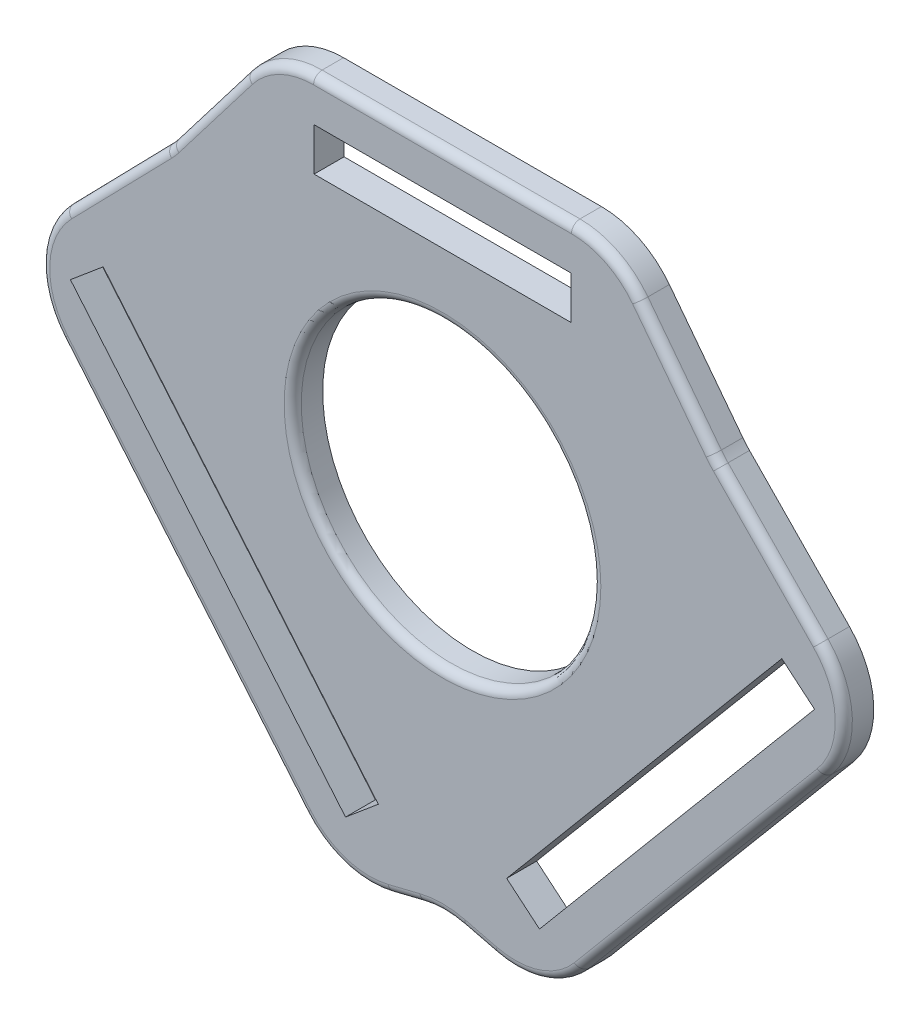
ISO-10303-21;
HEADER;
FILE_DESCRIPTION(('STEP AP214'),'2;1');
FILE_NAME('part.step','',(''),(''),'','','');
FILE_SCHEMA(('AUTOMOTIVE_DESIGN { 1 0 10303 214 1 1 1 1 }'));
ENDSEC;
DATA;
#1=APPLICATION_CONTEXT('core data for automotive mechanical design processes');
#2=APPLICATION_PROTOCOL_DEFINITION('international standard','automotive_design',2000,#1);
#3=PRODUCT_CONTEXT('',#1,'mechanical');
#4=PRODUCT('Part','Part','',(#3));
#5=PRODUCT_RELATED_PRODUCT_CATEGORY('part','',(#4));
#6=PRODUCT_DEFINITION_FORMATION('','',#4);
#7=PRODUCT_DEFINITION_CONTEXT('part definition',#1,'design');
#8=PRODUCT_DEFINITION('design','',#6,#7);
#9=PRODUCT_DEFINITION_SHAPE('','',#8);
#10=(LENGTH_UNIT() NAMED_UNIT(*) SI_UNIT(.MILLI.,.METRE.));
#11=(NAMED_UNIT(*) PLANE_ANGLE_UNIT() SI_UNIT($,.RADIAN.));
#12=(NAMED_UNIT(*) SI_UNIT($,.STERADIAN.) SOLID_ANGLE_UNIT());
#13=UNCERTAINTY_MEASURE_WITH_UNIT(LENGTH_MEASURE(1.E-05),#10,'distance_accuracy_value','');
#14=(GEOMETRIC_REPRESENTATION_CONTEXT(3) GLOBAL_UNCERTAINTY_ASSIGNED_CONTEXT((#13)) GLOBAL_UNIT_ASSIGNED_CONTEXT((#10,
#11,#12)) REPRESENTATION_CONTEXT('',''));
#15=CARTESIAN_POINT('',(0.,0.,0.));
#16=DIRECTION('',(0.,0.,1.));
#17=DIRECTION('',(1.,0.,0.));
#18=AXIS2_PLACEMENT_3D('',#15,#16,#17);
#19=CARTESIAN_POINT('',(-36.8842290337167,35.018760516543,3.5));
#20=DIRECTION('',(0.,0.,1.));
#21=DIRECTION('',(1.,0.,0.));
#22=AXIS2_PLACEMENT_3D('',#19,#20,#21);
#23=PLANE('',#22);
#24=CARTESIAN_POINT('',(-39.5216050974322,60.9592779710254,3.5));
#25=DIRECTION('',(0.,0.,1.));
#26=DIRECTION('',(1.,0.,0.));
#27=AXIS2_PLACEMENT_3D('',#24,#25,#26);
#28=CIRCLE('',#27,11.);
#29=CARTESIAN_POINT('',(-30.7890584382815,54.2702848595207,3.5));
#30=VERTEX_POINT('',#29);
#31=CARTESIAN_POINT('',(-31.6467784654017,53.2789716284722,3.5));
#32=VERTEX_POINT('',#31);
#33=EDGE_CURVE('E534',#30,#32,#28,.F.);
#34=ORIENTED_EDGE('',*,*,#33,.T.);
#35=DIRECTION('',(0.698209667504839,0.71589333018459,0.));
#36=VECTOR('',#35,1.);
#37=CARTESIAN_POINT('',(-43.327269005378,41.3026475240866,3.5));
#38=LINE('',#37,#36);
#39=CARTESIAN_POINT('',(-43.3272690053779,41.3026475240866,3.5));
#40=VERTEX_POINT('',#39);
#41=EDGE_CURVE('E559',#32,#40,#38,.F.);
#42=ORIENTED_EDGE('',*,*,#41,.T.);
#43=CARTESIAN_POINT('',(-36.8842290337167,35.018760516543,3.5));
#44=DIRECTION('',(0.,0.,1.));
#45=DIRECTION('',(1.,0.,0.));
#46=AXIS2_PLACEMENT_3D('',#43,#44,#45);
#47=CIRCLE('',#46,9.);
#48=CARTESIAN_POINT('',(-43.7786290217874,29.2336720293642,3.5));
#49=VERTEX_POINT('',#48);
#50=EDGE_CURVE('E557',#40,#49,#47,.T.);
#51=ORIENTED_EDGE('',*,*,#50,.T.);
#52=DIRECTION('',(-0.642787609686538,0.766044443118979,0.));
#53=VECTOR('',#52,1.);
#54=CARTESIAN_POINT('',(-43.7786290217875,29.2336720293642,3.5));
#55=LINE('',#54,#53);
#56=CARTESIAN_POINT('',(-15.4023416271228,-4.58387041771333,3.5));
#57=VERTEX_POINT('',#56);
#58=EDGE_CURVE('E555',#49,#57,#55,.F.);
#59=ORIENTED_EDGE('',*,*,#58,.T.);
#60=CARTESIAN_POINT('',(-8.50794163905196,1.20121806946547,3.5));
#61=DIRECTION('',(0.,0.,1.));
#62=DIRECTION('',(1.,0.,0.));
#63=AXIS2_PLACEMENT_3D('',#60,#61,#62);
#64=CIRCLE('',#63,9.);
#65=CARTESIAN_POINT('',(-6.35269814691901,-7.53691247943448,3.5));
#66=VERTEX_POINT('',#65);
#67=EDGE_CURVE('E553',#57,#66,#64,.T.);
#68=ORIENTED_EDGE('',*,*,#67,.T.);
#69=DIRECTION('',(-0.970903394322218,-0.239471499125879,0.));
#70=VECTOR('',#69,1.);
#71=CARTESIAN_POINT('',(-25.2389985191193,-12.1951830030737,3.5));
#72=LINE('',#71,#70);
#73=CARTESIAN_POINT('',(-2.63418649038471,-6.61974856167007,3.5));
#74=VERTEX_POINT('',#73);
#75=EDGE_CURVE('E551',#66,#74,#72,.F.);
#76=ORIENTED_EDGE('',*,*,#75,.T.);
#77=CARTESIAN_POINT('',(0.,-17.2996858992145,3.5));
#78=DIRECTION('',(0.,0.,1.));
#79=DIRECTION('',(1.,0.,0.));
#80=AXIS2_PLACEMENT_3D('',#77,#78,#79);
#81=CIRCLE('',#80,11.);
#82=CARTESIAN_POINT('',(2.63418649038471,-6.61974856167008,3.5));
#83=VERTEX_POINT('',#82);
#84=EDGE_CURVE('E549',#74,#83,#81,.F.);
#85=ORIENTED_EDGE('',*,*,#84,.T.);
#86=DIRECTION('',(0.970903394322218,-0.23947149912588,0.));
#87=VECTOR('',#86,1.);
#88=CARTESIAN_POINT('',(6.35269814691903,-7.53691247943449,3.5));
#89=LINE('',#88,#87);
#90=CARTESIAN_POINT('',(6.35269814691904,-7.53691247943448,3.5));
#91=VERTEX_POINT('',#90);
#92=EDGE_CURVE('E547',#83,#91,#89,.T.);
#93=ORIENTED_EDGE('',*,*,#92,.T.);
#94=CARTESIAN_POINT('',(8.50794163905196,1.20121806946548,3.5));
#95=DIRECTION('',(0.,0.,1.));
#96=DIRECTION('',(1.,0.,0.));
#97=AXIS2_PLACEMENT_3D('',#94,#95,#96);
#98=CIRCLE('',#97,9.);
#99=CARTESIAN_POINT('',(15.4023416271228,-4.58387041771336,3.5));
#100=VERTEX_POINT('',#99);
#101=EDGE_CURVE('E545',#91,#100,#98,.T.);
#102=ORIENTED_EDGE('',*,*,#101,.T.);
#103=DIRECTION('',(0.642787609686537,0.76604444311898,0.));
#104=VECTOR('',#103,1.);
#105=CARTESIAN_POINT('',(43.7786290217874,29.2336720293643,3.5));
#106=LINE('',#105,#104);
#107=CARTESIAN_POINT('',(43.7786290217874,29.2336720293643,3.5));
#108=VERTEX_POINT('',#107);
#109=EDGE_CURVE('E543',#100,#108,#106,.T.);
#110=ORIENTED_EDGE('',*,*,#109,.T.);
#111=CARTESIAN_POINT('',(36.8842290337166,35.0187605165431,3.5));
#112=DIRECTION('',(0.,0.,1.));
#113=DIRECTION('',(1.,0.,0.));
#114=AXIS2_PLACEMENT_3D('',#111,#112,#113);
#115=CIRCLE('',#114,9.00000000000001);
#116=CARTESIAN_POINT('',(43.3272690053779,41.3026475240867,3.5));
#117=VERTEX_POINT('',#116);
#118=EDGE_CURVE('E541',#108,#117,#115,.T.);
#119=ORIENTED_EDGE('',*,*,#118,.T.);
#120=DIRECTION('',(0.69820966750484,-0.715893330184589,0.));
#121=VECTOR('',#120,1.);
#122=CARTESIAN_POINT('',(7.36538619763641,78.1753424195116,3.5));
#123=LINE('',#122,#121);
#124=CARTESIAN_POINT('',(31.6467784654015,53.2789716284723,3.5));
#125=VERTEX_POINT('',#124);
#126=EDGE_CURVE('E539',#117,#125,#123,.F.);
#127=ORIENTED_EDGE('',*,*,#126,.T.);
#128=CARTESIAN_POINT('',(39.5216050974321,60.9592779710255,3.5));
#129=DIRECTION('',(0.,0.,1.));
#130=DIRECTION('',(1.,0.,0.));
#131=AXIS2_PLACEMENT_3D('',#128,#129,#130);
#132=CIRCLE('',#131,11.);
#133=CARTESIAN_POINT('',(30.7890584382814,54.2702848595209,3.5));
#134=VERTEX_POINT('',#133);
#135=EDGE_CURVE('E536',#125,#134,#132,.F.);
#136=ORIENTED_EDGE('',*,*,#135,.T.);
#137=DIRECTION('',(0.608090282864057,-0.793867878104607,0.));
#138=VECTOR('',#137,1.);
#139=CARTESIAN_POINT('',(15.0587955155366,74.8062986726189,3.5));
#140=LINE('',#139,#138);
#141=CARTESIAN_POINT('',(22.2080987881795,65.4728125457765,3.5));
#142=VERTEX_POINT('',#141);
#143=EDGE_CURVE('E532',#134,#142,#140,.F.);
#144=ORIENTED_EDGE('',*,*,#143,.T.);
#145=CARTESIAN_POINT('',(15.063287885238,60.,3.5));
#146=DIRECTION('',(0.,0.,1.));
#147=DIRECTION('',(1.,0.,0.));
#148=AXIS2_PLACEMENT_3D('',#145,#146,#147);
#149=CIRCLE('',#148,9.00000000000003);
#150=CARTESIAN_POINT('',(15.063287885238,69.,3.5));
#151=VERTEX_POINT('',#150);
#152=EDGE_CURVE('E530',#142,#151,#149,.T.);
#153=ORIENTED_EDGE('',*,*,#152,.T.);
#154=DIRECTION('',(1.,0.,0.));
#155=VECTOR('',#154,1.);
#156=CARTESIAN_POINT('',(-36.8842290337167,69.,3.5));
#157=LINE('',#156,#155);
#158=CARTESIAN_POINT('',(-15.063287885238,69.,3.5));
#159=VERTEX_POINT('',#158);
#160=EDGE_CURVE('E528',#151,#159,#157,.F.);
#161=ORIENTED_EDGE('',*,*,#160,.T.);
#162=CARTESIAN_POINT('',(-15.063287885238,60.,3.5));
#163=DIRECTION('',(0.,0.,1.));
#164=DIRECTION('',(1.,0.,0.));
#165=AXIS2_PLACEMENT_3D('',#162,#163,#164);
#166=CIRCLE('',#165,9.00000000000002);
#167=CARTESIAN_POINT('',(-22.2080987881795,65.4728125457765,3.5));
#168=VERTEX_POINT('',#167);
#169=EDGE_CURVE('E526',#159,#168,#166,.T.);
#170=ORIENTED_EDGE('',*,*,#169,.T.);
#171=DIRECTION('',(0.60809028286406,0.793867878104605,0.));
#172=VECTOR('',#171,1.);
#173=CARTESIAN_POINT('',(-42.3364379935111,39.1950666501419,3.5));
#174=LINE('',#173,#172);
#175=EDGE_CURVE('E524',#168,#30,#174,.F.);
#176=ORIENTED_EDGE('',*,*,#175,.T.);
#177=EDGE_LOOP('',(#34,#42,#51,#59,#68,#76,#85,#93,#102,#110,#119,#127,#136,#144,#153,#161,#170,#176));
#178=FACE_BOUND('',#177,.T.);
#179=CARTESIAN_POINT('',(0.,35.018760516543,3.5));
#180=DIRECTION('',(0.,0.,1.));
#181=DIRECTION('',(1.,0.,0.));
#182=AXIS2_PLACEMENT_3D('',#179,#180,#181);
#183=CIRCLE('',#182,18.5);
#184=CARTESIAN_POINT('',(18.5,35.018760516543,3.5));
#185=VERTEX_POINT('',#184);
#186=EDGE_CURVE('E521',#185,#185,#183,.F.);
#187=ORIENTED_EDGE('',*,*,#186,.T.);
#188=EDGE_LOOP('',(#187));
#189=FACE_BOUND('',#188,.T.);
#190=DIRECTION('',(-0.642787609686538,0.76604444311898,0.));
#191=VECTOR('',#190,1.);
#192=CARTESIAN_POINT('',(-40.7144512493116,31.8048224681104,3.5));
#193=LINE('',#192,#191);
#194=CARTESIAN_POINT('',(-11.3302222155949,-3.2139380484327,3.5));
#195=VERTEX_POINT('',#194);
#196=CARTESIAN_POINT('',(-43.4696026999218,35.0882841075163,3.5));
#197=VERTEX_POINT('',#196);
#198=EDGE_CURVE('E422',#195,#197,#193,.T.);
#199=ORIENTED_EDGE('',*,*,#198,.T.);
#200=DIRECTION('',(0.76604444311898,0.642787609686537,0.));
#201=VECTOR('',#200,1.);
#202=CARTESIAN_POINT('',(-39.6393804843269,38.302222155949,3.5));
#203=LINE('',#202,#201);
#204=CARTESIAN_POINT('',(-39.6393804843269,38.302222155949,3.5));
#205=VERTEX_POINT('',#204);
#206=EDGE_CURVE('E425',#197,#205,#203,.T.);
#207=ORIENTED_EDGE('',*,*,#206,.T.);
#208=DIRECTION('',(0.642787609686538,-0.766044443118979,0.));
#209=VECTOR('',#208,1.);
#210=CARTESIAN_POINT('',(-36.8842290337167,35.0187605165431,3.5));
#211=LINE('',#210,#209);
#212=CARTESIAN_POINT('',(-7.49999999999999,0.,3.5));
#213=VERTEX_POINT('',#212);
#214=EDGE_CURVE('E416',#205,#213,#211,.T.);
#215=ORIENTED_EDGE('',*,*,#214,.T.);
#216=DIRECTION('',(0.766044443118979,0.642787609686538,0.));
#217=VECTOR('',#216,1.);
#218=CARTESIAN_POINT('',(-7.5,0.,3.5));
#219=LINE('',#218,#217);
#220=EDGE_CURVE('E419',#195,#213,#219,.T.);
#221=ORIENTED_EDGE('',*,*,#220,.F.);
#222=EDGE_LOOP('',(#199,#207,#215,#221));
#223=FACE_BOUND('',#222,.T.);
#224=DIRECTION('',(1.,0.,0.));
#225=VECTOR('',#224,1.);
#226=CARTESIAN_POINT('',(-36.8842290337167,65.,3.5));
#227=LINE('',#226,#225);
#228=CARTESIAN_POINT('',(-15.,65.,3.5));
#229=VERTEX_POINT('',#228);
#230=CARTESIAN_POINT('',(15.,65.,3.5));
#231=VERTEX_POINT('',#230);
#232=EDGE_CURVE('E389',#229,#231,#227,.T.);
#233=ORIENTED_EDGE('',*,*,#232,.T.);
#234=DIRECTION('',(0.,-1.,0.));
#235=VECTOR('',#234,1.);
#236=CARTESIAN_POINT('',(15.,35.018760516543,3.5));
#237=LINE('',#236,#235);
#238=CARTESIAN_POINT('',(15.,60.,3.5));
#239=VERTEX_POINT('',#238);
#240=EDGE_CURVE('E392',#231,#239,#237,.T.);
#241=ORIENTED_EDGE('',*,*,#240,.T.);
#242=DIRECTION('',(-1.,0.,0.));
#243=VECTOR('',#242,1.);
#244=CARTESIAN_POINT('',(-36.8842290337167,60.,3.5));
#245=LINE('',#244,#243);
#246=CARTESIAN_POINT('',(-15.,60.,3.5));
#247=VERTEX_POINT('',#246);
#248=EDGE_CURVE('E383',#239,#247,#245,.T.);
#249=ORIENTED_EDGE('',*,*,#248,.T.);
#250=DIRECTION('',(0.,-1.,0.));
#251=VECTOR('',#250,1.);
#252=CARTESIAN_POINT('',(-15.,35.0187605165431,3.5));
#253=LINE('',#252,#251);
#254=EDGE_CURVE('E386',#229,#247,#253,.T.);
#255=ORIENTED_EDGE('',*,*,#254,.F.);
#256=EDGE_LOOP('',(#233,#241,#249,#255));
#257=FACE_BOUND('',#256,.T.);
#258=DIRECTION('',(-0.642787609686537,-0.76604444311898,0.));
#259=VECTOR('',#258,1.);
#260=CARTESIAN_POINT('',(10.2351013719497,-4.51905224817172,3.5));
#261=LINE('',#260,#259);
#262=CARTESIAN_POINT('',(43.4696026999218,35.0882841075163,3.5));
#263=VERTEX_POINT('',#262);
#264=CARTESIAN_POINT('',(11.3302222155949,-3.21393804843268,3.5));
#265=VERTEX_POINT('',#264);
#266=EDGE_CURVE('E359',#263,#265,#261,.T.);
#267=ORIENTED_EDGE('',*,*,#266,.T.);
#268=DIRECTION('',(-0.76604444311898,0.642787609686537,0.));
#269=VECTOR('',#268,1.);
#270=CARTESIAN_POINT('',(-35.7891081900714,36.3238747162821,3.5));
#271=LINE('',#270,#269);
#272=CARTESIAN_POINT('',(7.5,0.,3.5));
#273=VERTEX_POINT('',#272);
#274=EDGE_CURVE('E323',#265,#273,#271,.T.);
#275=ORIENTED_EDGE('',*,*,#274,.T.);
#276=DIRECTION('',(0.642787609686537,0.76604444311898,0.));
#277=VECTOR('',#276,1.);
#278=CARTESIAN_POINT('',(6.40487915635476,-1.30511419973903,3.5));
#279=LINE('',#278,#277);
#280=CARTESIAN_POINT('',(39.6393804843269,38.302222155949,3.5));
#281=VERTEX_POINT('',#280);
#282=EDGE_CURVE('E326',#273,#281,#279,.T.);
#283=ORIENTED_EDGE('',*,*,#282,.T.);
#284=DIRECTION('',(-0.76604444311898,0.642787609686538,0.));
#285=VECTOR('',#284,1.);
#286=CARTESIAN_POINT('',(-3.64972770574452,74.6260968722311,3.5));
#287=LINE('',#286,#285);
#288=EDGE_CURVE('E356',#263,#281,#287,.T.);
#289=ORIENTED_EDGE('',*,*,#288,.F.);
#290=EDGE_LOOP('',(#267,#275,#283,#289));
#291=FACE_BOUND('',#290,.T.);
#292=ADVANCED_FACE('F63',(#178,#189,#223,#257,#291),#23,.T.);
#293=CARTESIAN_POINT('',(-36.8842290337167,35.018760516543,0.));
#294=DIRECTION('',(0.,0.,1.));
#295=DIRECTION('',(1.,0.,0.));
#296=AXIS2_PLACEMENT_3D('',#293,#294,#295);
#297=PLANE('',#296);
#298=CARTESIAN_POINT('',(0.,35.018760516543,0.));
#299=DIRECTION('',(0.,0.,1.));
#300=DIRECTION('',(1.,0.,0.));
#301=AXIS2_PLACEMENT_3D('',#298,#299,#300);
#302=CIRCLE('',#301,17.5);
#303=CARTESIAN_POINT('',(17.5,35.018760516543,0.));
#304=VERTEX_POINT('',#303);
#305=EDGE_CURVE('E342',#304,#304,#302,.T.);
#306=ORIENTED_EDGE('',*,*,#305,.T.);
#307=EDGE_LOOP('',(#306));
#308=FACE_BOUND('',#307,.T.);
#309=DIRECTION('',(0.,1.,0.));
#310=VECTOR('',#309,1.);
#311=CARTESIAN_POINT('',(15.,0.,0.));
#312=LINE('',#311,#310);
#313=CARTESIAN_POINT('',(15.,60.,0.));
#314=VERTEX_POINT('',#313);
#315=CARTESIAN_POINT('',(15.,65.,0.));
#316=VERTEX_POINT('',#315);
#317=EDGE_CURVE('E362',#314,#316,#312,.T.);
#318=ORIENTED_EDGE('',*,*,#317,.T.);
#319=DIRECTION('',(-1.,0.,0.));
#320=VECTOR('',#319,1.);
#321=CARTESIAN_POINT('',(0.,65.,0.));
#322=LINE('',#321,#320);
#323=CARTESIAN_POINT('',(-15.,65.,0.));
#324=VERTEX_POINT('',#323);
#325=EDGE_CURVE('E365',#316,#324,#322,.T.);
#326=ORIENTED_EDGE('',*,*,#325,.T.);
#327=DIRECTION('',(0.,1.,0.));
#328=VECTOR('',#327,1.);
#329=CARTESIAN_POINT('',(-15.,0.,0.));
#330=LINE('',#329,#328);
#331=CARTESIAN_POINT('',(-15.,60.,0.));
#332=VERTEX_POINT('',#331);
#333=EDGE_CURVE('E368',#332,#324,#330,.T.);
#334=ORIENTED_EDGE('',*,*,#333,.F.);
#335=DIRECTION('',(1.,0.,0.));
#336=VECTOR('',#335,1.);
#337=CARTESIAN_POINT('',(0.,60.,0.));
#338=LINE('',#337,#336);
#339=EDGE_CURVE('E371',#332,#314,#338,.T.);
#340=ORIENTED_EDGE('',*,*,#339,.T.);
#341=EDGE_LOOP('',(#318,#326,#334,#340));
#342=FACE_BOUND('',#341,.T.);
#343=CARTESIAN_POINT('',(-36.8842290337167,35.018760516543,0.));
#344=DIRECTION('',(0.,0.,1.));
#345=DIRECTION('',(1.,0.,0.));
#346=AXIS2_PLACEMENT_3D('',#343,#344,#345);
#347=CIRCLE('',#346,10.);
#348=CARTESIAN_POINT('',(-44.0431623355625,42.0008571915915,0.));
#349=VERTEX_POINT('',#348);
#350=CARTESIAN_POINT('',(-44.5446734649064,28.5908844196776,0.));
#351=VERTEX_POINT('',#350);
#352=EDGE_CURVE('E428',#349,#351,#347,.T.);
#353=ORIENTED_EDGE('',*,*,#352,.F.);
#354=DIRECTION('',(0.698209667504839,0.71589333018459,0.));
#355=VECTOR('',#354,1.);
#356=CARTESIAN_POINT('',(-44.0431623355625,42.0008571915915,0.));
#357=LINE('',#356,#355);
#358=CARTESIAN_POINT('',(-32.3626717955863,53.977181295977,0.));
#359=VERTEX_POINT('',#358);
#360=EDGE_CURVE('E479',#349,#359,#357,.T.);
#361=ORIENTED_EDGE('',*,*,#360,.T.);
#362=CARTESIAN_POINT('',(-39.5216050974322,60.9592779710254,0.));
#363=DIRECTION('',(0.,0.,-1.));
#364=DIRECTION('',(-1.,0.,0.));
#365=AXIS2_PLACEMENT_3D('',#362,#363,#364);
#366=CIRCLE('',#365,10.);
#367=CARTESIAN_POINT('',(-31.5829263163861,54.8783751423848,0.));
#368=VERTEX_POINT('',#367);
#369=EDGE_CURVE('E476',#368,#359,#366,.T.);
#370=ORIENTED_EDGE('',*,*,#369,.F.);
#371=DIRECTION('',(0.60809028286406,0.793867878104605,0.));
#372=VECTOR('',#371,1.);
#373=CARTESIAN_POINT('',(-31.5829263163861,54.8783751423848,0.));
#374=LINE('',#373,#372);
#375=CARTESIAN_POINT('',(-23.0019666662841,66.0809028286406,0.));
#376=VERTEX_POINT('',#375);
#377=EDGE_CURVE('E473',#368,#376,#374,.T.);
#378=ORIENTED_EDGE('',*,*,#377,.T.);
#379=CARTESIAN_POINT('',(-15.063287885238,60.,0.));
#380=DIRECTION('',(0.,0.,-1.));
#381=DIRECTION('',(-1.,0.,0.));
#382=AXIS2_PLACEMENT_3D('',#379,#380,#381);
#383=CIRCLE('',#382,10.);
#384=CARTESIAN_POINT('',(-15.063287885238,70.,0.));
#385=VERTEX_POINT('',#384);
#386=EDGE_CURVE('E470',#376,#385,#383,.T.);
#387=ORIENTED_EDGE('',*,*,#386,.T.);
#388=DIRECTION('',(1.,0.,0.));
#389=VECTOR('',#388,1.);
#390=CARTESIAN_POINT('',(-15.063287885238,70.,0.));
#391=LINE('',#390,#389);
#392=CARTESIAN_POINT('',(15.063287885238,70.,0.));
#393=VERTEX_POINT('',#392);
#394=EDGE_CURVE('E467',#385,#393,#391,.T.);
#395=ORIENTED_EDGE('',*,*,#394,.T.);
#396=CARTESIAN_POINT('',(15.063287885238,60.,0.));
#397=DIRECTION('',(0.,0.,1.));
#398=DIRECTION('',(1.,0.,0.));
#399=AXIS2_PLACEMENT_3D('',#396,#397,#398);
#400=CIRCLE('',#399,10.);
#401=CARTESIAN_POINT('',(23.0019666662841,66.0809028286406,0.));
#402=VERTEX_POINT('',#401);
#403=EDGE_CURVE('E464',#402,#393,#400,.T.);
#404=ORIENTED_EDGE('',*,*,#403,.F.);
#405=DIRECTION('',(0.608090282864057,-0.793867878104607,0.));
#406=VECTOR('',#405,1.);
#407=CARTESIAN_POINT('',(23.0019666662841,66.0809028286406,0.));
#408=LINE('',#407,#406);
#409=CARTESIAN_POINT('',(31.582926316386,54.8783751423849,0.));
#410=VERTEX_POINT('',#409);
#411=EDGE_CURVE('E461',#402,#410,#408,.T.);
#412=ORIENTED_EDGE('',*,*,#411,.T.);
#413=CARTESIAN_POINT('',(39.5216050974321,60.9592779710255,0.));
#414=DIRECTION('',(0.,0.,1.));
#415=DIRECTION('',(1.,0.,0.));
#416=AXIS2_PLACEMENT_3D('',#413,#414,#415);
#417=CIRCLE('',#416,10.);
#418=CARTESIAN_POINT('',(32.3626717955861,53.9771812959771,0.));
#419=VERTEX_POINT('',#418);
#420=EDGE_CURVE('E458',#410,#419,#417,.T.);
#421=ORIENTED_EDGE('',*,*,#420,.T.);
#422=DIRECTION('',(0.69820966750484,-0.715893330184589,0.));
#423=VECTOR('',#422,1.);
#424=CARTESIAN_POINT('',(32.3626717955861,53.9771812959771,0.));
#425=LINE('',#424,#423);
#426=CARTESIAN_POINT('',(44.0431623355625,42.0008571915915,0.));
#427=VERTEX_POINT('',#426);
#428=EDGE_CURVE('E455',#419,#427,#425,.T.);
#429=ORIENTED_EDGE('',*,*,#428,.T.);
#430=CARTESIAN_POINT('',(36.8842290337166,35.0187605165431,0.));
#431=DIRECTION('',(0.,0.,1.));
#432=DIRECTION('',(1.,0.,0.));
#433=AXIS2_PLACEMENT_3D('',#430,#431,#432);
#434=CIRCLE('',#433,10.);
#435=CARTESIAN_POINT('',(44.5446734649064,28.5908844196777,0.));
#436=VERTEX_POINT('',#435);
#437=EDGE_CURVE('E452',#436,#427,#434,.T.);
#438=ORIENTED_EDGE('',*,*,#437,.F.);
#439=DIRECTION('',(0.642787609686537,0.76604444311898,0.));
#440=VECTOR('',#439,1.);
#441=CARTESIAN_POINT('',(16.1683860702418,-5.22665802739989,0.));
#442=LINE('',#441,#440);
#443=CARTESIAN_POINT('',(16.1683860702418,-5.22665802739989,0.));
#444=VERTEX_POINT('',#443);
#445=EDGE_CURVE('E449',#444,#436,#442,.T.);
#446=ORIENTED_EDGE('',*,*,#445,.F.);
#447=CARTESIAN_POINT('',(8.50794163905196,1.20121806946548,0.));
#448=DIRECTION('',(0.,0.,1.));
#449=DIRECTION('',(1.,0.,0.));
#450=AXIS2_PLACEMENT_3D('',#447,#448,#449);
#451=CIRCLE('',#450,10.);
#452=CARTESIAN_POINT('',(6.11322664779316,-8.5078158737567,0.));
#453=VERTEX_POINT('',#452);
#454=EDGE_CURVE('E446',#453,#444,#451,.T.);
#455=ORIENTED_EDGE('',*,*,#454,.F.);
#456=DIRECTION('',(0.970903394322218,-0.23947149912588,0.));
#457=VECTOR('',#456,1.);
#458=CARTESIAN_POINT('',(2.39471499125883,-7.59065195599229,0.));
#459=LINE('',#458,#457);
#460=CARTESIAN_POINT('',(2.39471499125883,-7.59065195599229,0.));
#461=VERTEX_POINT('',#460);
#462=EDGE_CURVE('E443',#461,#453,#459,.T.);
#463=ORIENTED_EDGE('',*,*,#462,.F.);
#464=CARTESIAN_POINT('',(0.,-17.2996858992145,0.));
#465=DIRECTION('',(0.,0.,1.));
#466=DIRECTION('',(1.,0.,0.));
#467=AXIS2_PLACEMENT_3D('',#464,#465,#466);
#468=CIRCLE('',#467,10.);
#469=CARTESIAN_POINT('',(-2.39471499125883,-7.59065195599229,0.));
#470=VERTEX_POINT('',#469);
#471=EDGE_CURVE('E440',#461,#470,#468,.T.);
#472=ORIENTED_EDGE('',*,*,#471,.T.);
#473=DIRECTION('',(-0.970903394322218,-0.239471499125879,0.));
#474=VECTOR('',#473,1.);
#475=CARTESIAN_POINT('',(-2.39471499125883,-7.59065195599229,0.));
#476=LINE('',#475,#474);
#477=CARTESIAN_POINT('',(-6.11322664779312,-8.50781587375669,0.));
#478=VERTEX_POINT('',#477);
#479=EDGE_CURVE('E437',#470,#478,#476,.T.);
#480=ORIENTED_EDGE('',*,*,#479,.T.);
#481=CARTESIAN_POINT('',(-8.50794163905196,1.20121806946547,0.));
#482=DIRECTION('',(0.,0.,1.));
#483=DIRECTION('',(1.,0.,0.));
#484=AXIS2_PLACEMENT_3D('',#481,#482,#483);
#485=CIRCLE('',#484,10.);
#486=CARTESIAN_POINT('',(-16.1683860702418,-5.22665802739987,0.));
#487=VERTEX_POINT('',#486);
#488=EDGE_CURVE('E434',#487,#478,#485,.T.);
#489=ORIENTED_EDGE('',*,*,#488,.F.);
#490=DIRECTION('',(-0.642787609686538,0.766044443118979,0.));
#491=VECTOR('',#490,1.);
#492=CARTESIAN_POINT('',(-16.1683860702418,-5.22665802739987,0.));
#493=LINE('',#492,#491);
#494=EDGE_CURVE('E431',#487,#351,#493,.T.);
#495=ORIENTED_EDGE('',*,*,#494,.T.);
#496=EDGE_LOOP('',(#353,#361,#370,#378,#387,#395,#404,#412,#421,#429,#438,#446,#455,#463,#472,
#480,#489,#495));
#497=FACE_BOUND('',#496,.T.);
#498=DIRECTION('',(-0.76604444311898,-0.642787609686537,0.));
#499=VECTOR('',#498,1.);
#500=CARTESIAN_POINT('',(-35.2381998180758,41.9952512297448,0.));
#501=LINE('',#500,#499);
#502=CARTESIAN_POINT('',(-39.6393804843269,38.302222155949,0.));
#503=VERTEX_POINT('',#502);
#504=CARTESIAN_POINT('',(-43.4696026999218,35.0882841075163,0.));
#505=VERTEX_POINT('',#504);
#506=EDGE_CURVE('E395',#503,#505,#501,.T.);
#507=ORIENTED_EDGE('',*,*,#506,.T.);
#508=DIRECTION('',(0.642787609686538,-0.766044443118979,0.));
#509=VECTOR('',#508,1.);
#510=CARTESIAN_POINT('',(-8.23140288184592,-6.90696712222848,0.));
#511=LINE('',#510,#509);
#512=CARTESIAN_POINT('',(-11.3302222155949,-3.2139380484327,0.));
#513=VERTEX_POINT('',#512);
#514=EDGE_CURVE('E398',#505,#513,#511,.T.);
#515=ORIENTED_EDGE('',*,*,#514,.T.);
#516=DIRECTION('',(-0.766044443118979,-0.642787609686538,0.));
#517=VECTOR('',#516,1.);
#518=CARTESIAN_POINT('',(-3.098819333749,3.69302907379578,0.));
#519=LINE('',#518,#517);
#520=CARTESIAN_POINT('',(-7.5,0.,0.));
#521=VERTEX_POINT('',#520);
#522=EDGE_CURVE('E401',#521,#513,#519,.T.);
#523=ORIENTED_EDGE('',*,*,#522,.F.);
#524=DIRECTION('',(-0.642787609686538,0.766044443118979,0.));
#525=VECTOR('',#524,1.);
#526=CARTESIAN_POINT('',(-4.401180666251,-3.69302907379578,0.));
#527=LINE('',#526,#525);
#528=EDGE_CURVE('E404',#521,#503,#527,.T.);
#529=ORIENTED_EDGE('',*,*,#528,.T.);
#530=EDGE_LOOP('',(#507,#515,#523,#529));
#531=FACE_BOUND('',#530,.T.);
#532=DIRECTION('',(0.76604444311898,-0.642787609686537,0.));
#533=VECTOR('',#532,1.);
#534=CARTESIAN_POINT('',(3.09881933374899,3.69302907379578,0.));
#535=LINE('',#534,#533);
#536=CARTESIAN_POINT('',(7.50000000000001,0.,0.));
#537=VERTEX_POINT('',#536);
#538=CARTESIAN_POINT('',(11.3302222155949,-3.21393804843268,0.));
#539=VERTEX_POINT('',#538);
#540=EDGE_CURVE('E320',#537,#539,#535,.T.);
#541=ORIENTED_EDGE('',*,*,#540,.T.);
#542=DIRECTION('',(0.642787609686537,0.76604444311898,0.));
#543=VECTOR('',#542,1.);
#544=CARTESIAN_POINT('',(8.23140288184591,-6.90696712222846,0.));
#545=LINE('',#544,#543);
#546=CARTESIAN_POINT('',(43.4696026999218,35.0882841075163,0.));
#547=VERTEX_POINT('',#546);
#548=EDGE_CURVE('E330',#539,#547,#545,.T.);
#549=ORIENTED_EDGE('',*,*,#548,.T.);
#550=DIRECTION('',(0.766044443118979,-0.642787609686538,0.));
#551=VECTOR('',#550,1.);
#552=CARTESIAN_POINT('',(35.2381998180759,41.9952512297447,0.));
#553=LINE('',#552,#551);
#554=CARTESIAN_POINT('',(39.6393804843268,38.302222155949,0.));
#555=VERTEX_POINT('',#554);
#556=EDGE_CURVE('E336',#555,#547,#553,.T.);
#557=ORIENTED_EDGE('',*,*,#556,.F.);
#558=DIRECTION('',(-0.642787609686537,-0.76604444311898,0.));
#559=VECTOR('',#558,1.);
#560=CARTESIAN_POINT('',(4.40118066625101,-3.69302907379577,0.));
#561=LINE('',#560,#559);
#562=EDGE_CURVE('E341',#555,#537,#561,.T.);
#563=ORIENTED_EDGE('',*,*,#562,.T.);
#564=EDGE_LOOP('',(#541,#549,#557,#563));
#565=FACE_BOUND('',#564,.T.);
#566=ADVANCED_FACE('F339',(#308,#342,#497,#531,#565),#297,.F.);
#567=CARTESIAN_POINT('',(-36.8842290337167,35.018760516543,3.5));
#568=DIRECTION('',(0.,0.,-1.));
#569=DIRECTION('',(-1.,0.,0.));
#570=AXIS2_PLACEMENT_3D('',#567,#568,#569);
#571=CYLINDRICAL_SURFACE('',#570,10.);
#572=DIRECTION('',(0.,0.,-1.));
#573=VECTOR('',#572,1.);
#574=CARTESIAN_POINT('',(-44.5446734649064,28.5908844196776,3.5));
#575=LINE('',#574,#573);
#576=CARTESIAN_POINT('',(-44.5446734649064,28.5908844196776,2.5));
#577=VERTEX_POINT('',#576);
#578=EDGE_CURVE('E516',#577,#351,#575,.T.);
#579=ORIENTED_EDGE('',*,*,#578,.F.);
#580=CARTESIAN_POINT('',(-36.8842290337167,35.018760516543,2.5));
#581=DIRECTION('',(0.,0.,1.));
#582=DIRECTION('',(1.,0.,0.));
#583=AXIS2_PLACEMENT_3D('',#580,#581,#582);
#584=CIRCLE('',#583,10.);
#585=CARTESIAN_POINT('',(-44.0431623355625,42.0008571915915,2.5));
#586=VERTEX_POINT('',#585);
#587=EDGE_CURVE('E565',#577,#586,#584,.F.);
#588=ORIENTED_EDGE('',*,*,#587,.T.);
#589=DIRECTION('',(0.,0.,-1.));
#590=VECTOR('',#589,1.);
#591=CARTESIAN_POINT('',(-44.0431623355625,42.0008571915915,3.5));
#592=LINE('',#591,#590);
#593=EDGE_CURVE('E482',#586,#349,#592,.T.);
#594=ORIENTED_EDGE('',*,*,#593,.T.);
#595=ORIENTED_EDGE('',*,*,#352,.T.);
#596=EDGE_LOOP('',(#579,#588,#594,#595));
#597=FACE_BOUND('',#596,.T.);
#598=ADVANCED_FACE('F684',(#597),#571,.T.);
#599=CARTESIAN_POINT('',(-16.1683860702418,-5.22665802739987,3.5));
#600=DIRECTION('',(-0.766044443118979,-0.642787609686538,0.));
#601=DIRECTION('',(0.642787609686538,-0.766044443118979,0.));
#602=AXIS2_PLACEMENT_3D('',#599,#600,#601);
#603=PLANE('',#602);
#604=DIRECTION('',(0.,0.,-1.));
#605=VECTOR('',#604,1.);
#606=CARTESIAN_POINT('',(-16.1683860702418,-5.22665802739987,3.5));
#607=LINE('',#606,#605);
#608=CARTESIAN_POINT('',(-16.1683860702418,-5.22665802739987,2.5));
#609=VERTEX_POINT('',#608);
#610=EDGE_CURVE('E514',#609,#487,#607,.T.);
#611=ORIENTED_EDGE('',*,*,#610,.F.);
#612=DIRECTION('',(-0.642787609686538,0.766044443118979,0.));
#613=VECTOR('',#612,1.);
#614=CARTESIAN_POINT('',(-16.1683860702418,-5.22665802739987,2.5));
#615=LINE('',#614,#613);
#616=EDGE_CURVE('E567',#609,#577,#615,.T.);
#617=ORIENTED_EDGE('',*,*,#616,.T.);
#618=ORIENTED_EDGE('',*,*,#578,.T.);
#619=ORIENTED_EDGE('',*,*,#494,.F.);
#620=EDGE_LOOP('',(#611,#617,#618,#619));
#621=FACE_BOUND('',#620,.T.);
#622=ADVANCED_FACE('F688',(#621),#603,.T.);
#623=CARTESIAN_POINT('',(-8.50794163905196,1.20121806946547,3.5));
#624=DIRECTION('',(0.,0.,-1.));
#625=DIRECTION('',(-1.,0.,0.));
#626=AXIS2_PLACEMENT_3D('',#623,#624,#625);
#627=CYLINDRICAL_SURFACE('',#626,10.);
#628=DIRECTION('',(0.,0.,-1.));
#629=VECTOR('',#628,1.);
#630=CARTESIAN_POINT('',(-6.11322664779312,-8.50781587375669,3.5));
#631=LINE('',#630,#629);
#632=CARTESIAN_POINT('',(-6.11322664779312,-8.50781587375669,2.5));
#633=VERTEX_POINT('',#632);
#634=EDGE_CURVE('E512',#633,#478,#631,.T.);
#635=ORIENTED_EDGE('',*,*,#634,.F.);
#636=CARTESIAN_POINT('',(-8.50794163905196,1.20121806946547,2.5));
#637=DIRECTION('',(0.,0.,1.));
#638=DIRECTION('',(1.,0.,0.));
#639=AXIS2_PLACEMENT_3D('',#636,#637,#638);
#640=CIRCLE('',#639,10.);
#641=EDGE_CURVE('E569',#633,#609,#640,.F.);
#642=ORIENTED_EDGE('',*,*,#641,.T.);
#643=ORIENTED_EDGE('',*,*,#610,.T.);
#644=ORIENTED_EDGE('',*,*,#488,.T.);
#645=EDGE_LOOP('',(#635,#642,#643,#644));
#646=FACE_BOUND('',#645,.T.);
#647=ADVANCED_FACE('F692',(#646),#627,.T.);
#648=CARTESIAN_POINT('',(-2.39471499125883,-7.59065195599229,3.5));
#649=DIRECTION('',(0.239471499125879,-0.970903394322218,0.));
#650=DIRECTION('',(0.970903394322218,0.239471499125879,0.));
#651=AXIS2_PLACEMENT_3D('',#648,#649,#650);
#652=PLANE('',#651);
#653=DIRECTION('',(0.,0.,-1.));
#654=VECTOR('',#653,1.);
#655=CARTESIAN_POINT('',(-2.39471499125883,-7.59065195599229,3.5));
#656=LINE('',#655,#654);
#657=CARTESIAN_POINT('',(-2.39471499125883,-7.59065195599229,2.5));
#658=VERTEX_POINT('',#657);
#659=EDGE_CURVE('E510',#658,#470,#656,.T.);
#660=ORIENTED_EDGE('',*,*,#659,.F.);
#661=DIRECTION('',(-0.970903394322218,-0.239471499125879,0.));
#662=VECTOR('',#661,1.);
#663=CARTESIAN_POINT('',(-2.39471499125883,-7.59065195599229,2.5));
#664=LINE('',#663,#662);
#665=EDGE_CURVE('E571',#658,#633,#664,.T.);
#666=ORIENTED_EDGE('',*,*,#665,.T.);
#667=ORIENTED_EDGE('',*,*,#634,.T.);
#668=ORIENTED_EDGE('',*,*,#479,.F.);
#669=EDGE_LOOP('',(#660,#666,#667,#668));
#670=FACE_BOUND('',#669,.T.);
#671=ADVANCED_FACE('F698',(#670),#652,.T.);
#672=CARTESIAN_POINT('',(0.,-17.2996858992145,3.5));
#673=DIRECTION('',(0.,0.,-1.));
#674=DIRECTION('',(-1.,0.,0.));
#675=AXIS2_PLACEMENT_3D('',#672,#673,#674);
#676=CYLINDRICAL_SURFACE('',#675,10.);
#677=DIRECTION('',(0.,0.,-1.));
#678=VECTOR('',#677,1.);
#679=CARTESIAN_POINT('',(2.39471499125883,-7.59065195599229,3.5));
#680=LINE('',#679,#678);
#681=CARTESIAN_POINT('',(2.39471499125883,-7.59065195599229,2.5));
#682=VERTEX_POINT('',#681);
#683=EDGE_CURVE('E508',#682,#461,#680,.T.);
#684=ORIENTED_EDGE('',*,*,#683,.F.);
#685=CARTESIAN_POINT('',(0.,-17.2996858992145,2.5));
#686=DIRECTION('',(0.,0.,1.));
#687=DIRECTION('',(1.,0.,0.));
#688=AXIS2_PLACEMENT_3D('',#685,#686,#687);
#689=CIRCLE('',#688,10.);
#690=EDGE_CURVE('E573',#682,#658,#689,.T.);
#691=ORIENTED_EDGE('',*,*,#690,.T.);
#692=ORIENTED_EDGE('',*,*,#659,.T.);
#693=ORIENTED_EDGE('',*,*,#471,.F.);
#694=EDGE_LOOP('',(#684,#691,#692,#693));
#695=FACE_BOUND('',#694,.T.);
#696=ADVANCED_FACE('F827',(#695),#676,.F.);
#697=CARTESIAN_POINT('',(2.39471499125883,-7.59065195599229,3.5));
#698=DIRECTION('',(0.23947149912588,0.970903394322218,0.));
#699=DIRECTION('',(-0.970903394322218,0.23947149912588,0.));
#700=AXIS2_PLACEMENT_3D('',#697,#698,#699);
#701=PLANE('',#700);
#702=DIRECTION('',(0.,0.,-1.));
#703=VECTOR('',#702,1.);
#704=CARTESIAN_POINT('',(6.11322664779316,-8.5078158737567,3.5));
#705=LINE('',#704,#703);
#706=CARTESIAN_POINT('',(6.11322664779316,-8.5078158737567,2.5));
#707=VERTEX_POINT('',#706);
#708=EDGE_CURVE('E506',#707,#453,#705,.T.);
#709=ORIENTED_EDGE('',*,*,#708,.F.);
#710=DIRECTION('',(0.970903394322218,-0.23947149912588,0.));
#711=VECTOR('',#710,1.);
#712=CARTESIAN_POINT('',(2.39471499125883,-7.59065195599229,2.5));
#713=LINE('',#712,#711);
#714=EDGE_CURVE('E575',#707,#682,#713,.F.);
#715=ORIENTED_EDGE('',*,*,#714,.T.);
#716=ORIENTED_EDGE('',*,*,#683,.T.);
#717=ORIENTED_EDGE('',*,*,#462,.T.);
#718=EDGE_LOOP('',(#709,#715,#716,#717));
#719=FACE_BOUND('',#718,.T.);
#720=ADVANCED_FACE('F823',(#719),#701,.F.);
#721=CARTESIAN_POINT('',(8.50794163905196,1.20121806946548,3.5));
#722=DIRECTION('',(0.,0.,-1.));
#723=DIRECTION('',(-1.,0.,0.));
#724=AXIS2_PLACEMENT_3D('',#721,#722,#723);
#725=CYLINDRICAL_SURFACE('',#724,10.);
#726=DIRECTION('',(0.,0.,-1.));
#727=VECTOR('',#726,1.);
#728=CARTESIAN_POINT('',(16.1683860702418,-5.22665802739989,3.5));
#729=LINE('',#728,#727);
#730=CARTESIAN_POINT('',(16.1683860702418,-5.22665802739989,2.5));
#731=VERTEX_POINT('',#730);
#732=EDGE_CURVE('E504',#731,#444,#729,.T.);
#733=ORIENTED_EDGE('',*,*,#732,.F.);
#734=CARTESIAN_POINT('',(8.50794163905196,1.20121806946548,2.5));
#735=DIRECTION('',(0.,0.,1.));
#736=DIRECTION('',(1.,0.,0.));
#737=AXIS2_PLACEMENT_3D('',#734,#735,#736);
#738=CIRCLE('',#737,10.);
#739=EDGE_CURVE('E577',#731,#707,#738,.F.);
#740=ORIENTED_EDGE('',*,*,#739,.T.);
#741=ORIENTED_EDGE('',*,*,#708,.T.);
#742=ORIENTED_EDGE('',*,*,#454,.T.);
#743=EDGE_LOOP('',(#733,#740,#741,#742));
#744=FACE_BOUND('',#743,.T.);
#745=ADVANCED_FACE('F819',(#744),#725,.T.);
#746=CARTESIAN_POINT('',(16.1683860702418,-5.22665802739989,3.5));
#747=DIRECTION('',(-0.76604444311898,0.642787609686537,0.));
#748=DIRECTION('',(-0.642787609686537,-0.76604444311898,0.));
#749=AXIS2_PLACEMENT_3D('',#746,#747,#748);
#750=PLANE('',#749);
#751=DIRECTION('',(0.,0.,-1.));
#752=VECTOR('',#751,1.);
#753=CARTESIAN_POINT('',(44.5446734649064,28.5908844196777,3.5));
#754=LINE('',#753,#752);
#755=CARTESIAN_POINT('',(44.5446734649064,28.5908844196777,2.5));
#756=VERTEX_POINT('',#755);
#757=EDGE_CURVE('E502',#756,#436,#754,.T.);
#758=ORIENTED_EDGE('',*,*,#757,.F.);
#759=DIRECTION('',(0.642787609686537,0.76604444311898,0.));
#760=VECTOR('',#759,1.);
#761=CARTESIAN_POINT('',(16.1683860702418,-5.22665802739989,2.5));
#762=LINE('',#761,#760);
#763=EDGE_CURVE('E579',#756,#731,#762,.F.);
#764=ORIENTED_EDGE('',*,*,#763,.T.);
#765=ORIENTED_EDGE('',*,*,#732,.T.);
#766=ORIENTED_EDGE('',*,*,#445,.T.);
#767=EDGE_LOOP('',(#758,#764,#765,#766));
#768=FACE_BOUND('',#767,.T.);
#769=ADVANCED_FACE('F815',(#768),#750,.F.);
#770=CARTESIAN_POINT('',(36.8842290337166,35.0187605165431,3.5));
#771=DIRECTION('',(0.,0.,-1.));
#772=DIRECTION('',(-1.,0.,0.));
#773=AXIS2_PLACEMENT_3D('',#770,#771,#772);
#774=CYLINDRICAL_SURFACE('',#773,10.);
#775=DIRECTION('',(0.,0.,-1.));
#776=VECTOR('',#775,1.);
#777=CARTESIAN_POINT('',(44.0431623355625,42.0008571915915,3.5));
#778=LINE('',#777,#776);
#779=CARTESIAN_POINT('',(44.0431623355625,42.0008571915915,2.5));
#780=VERTEX_POINT('',#779);
#781=EDGE_CURVE('E500',#780,#427,#778,.T.);
#782=ORIENTED_EDGE('',*,*,#781,.F.);
#783=CARTESIAN_POINT('',(36.8842290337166,35.0187605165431,2.5));
#784=DIRECTION('',(0.,0.,1.));
#785=DIRECTION('',(1.,0.,0.));
#786=AXIS2_PLACEMENT_3D('',#783,#784,#785);
#787=CIRCLE('',#786,10.);
#788=EDGE_CURVE('E581',#780,#756,#787,.F.);
#789=ORIENTED_EDGE('',*,*,#788,.T.);
#790=ORIENTED_EDGE('',*,*,#757,.T.);
#791=ORIENTED_EDGE('',*,*,#437,.T.);
#792=EDGE_LOOP('',(#782,#789,#790,#791));
#793=FACE_BOUND('',#792,.T.);
#794=ADVANCED_FACE('F811',(#793),#774,.T.);
#795=CARTESIAN_POINT('',(32.3626717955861,53.9771812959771,3.5));
#796=DIRECTION('',(0.715893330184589,0.69820966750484,0.));
#797=DIRECTION('',(-0.69820966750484,0.715893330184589,0.));
#798=AXIS2_PLACEMENT_3D('',#795,#796,#797);
#799=PLANE('',#798);
#800=DIRECTION('',(0.,0.,-1.));
#801=VECTOR('',#800,1.);
#802=CARTESIAN_POINT('',(32.3626717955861,53.9771812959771,3.5));
#803=LINE('',#802,#801);
#804=CARTESIAN_POINT('',(32.3626717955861,53.9771812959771,2.5));
#805=VERTEX_POINT('',#804);
#806=EDGE_CURVE('E498',#805,#419,#803,.T.);
#807=ORIENTED_EDGE('',*,*,#806,.F.);
#808=DIRECTION('',(0.69820966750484,-0.715893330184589,0.));
#809=VECTOR('',#808,1.);
#810=CARTESIAN_POINT('',(32.3626717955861,53.9771812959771,2.5));
#811=LINE('',#810,#809);
#812=EDGE_CURVE('E583',#805,#780,#811,.T.);
#813=ORIENTED_EDGE('',*,*,#812,.T.);
#814=ORIENTED_EDGE('',*,*,#781,.T.);
#815=ORIENTED_EDGE('',*,*,#428,.F.);
#816=EDGE_LOOP('',(#807,#813,#814,#815));
#817=FACE_BOUND('',#816,.T.);
#818=ADVANCED_FACE('F807',(#817),#799,.T.);
#819=CARTESIAN_POINT('',(39.5216050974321,60.9592779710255,3.5));
#820=DIRECTION('',(0.,0.,-1.));
#821=DIRECTION('',(-1.,0.,0.));
#822=AXIS2_PLACEMENT_3D('',#819,#820,#821);
#823=CYLINDRICAL_SURFACE('',#822,10.);
#824=DIRECTION('',(0.,0.,-1.));
#825=VECTOR('',#824,1.);
#826=CARTESIAN_POINT('',(31.582926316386,54.8783751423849,3.5));
#827=LINE('',#826,#825);
#828=CARTESIAN_POINT('',(31.582926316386,54.8783751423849,2.5));
#829=VERTEX_POINT('',#828);
#830=EDGE_CURVE('E496',#829,#410,#827,.T.);
#831=ORIENTED_EDGE('',*,*,#830,.F.);
#832=CARTESIAN_POINT('',(39.5216050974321,60.9592779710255,2.5));
#833=DIRECTION('',(0.,0.,1.));
#834=DIRECTION('',(1.,0.,0.));
#835=AXIS2_PLACEMENT_3D('',#832,#833,#834);
#836=CIRCLE('',#835,10.);
#837=EDGE_CURVE('E518',#829,#805,#836,.T.);
#838=ORIENTED_EDGE('',*,*,#837,.T.);
#839=ORIENTED_EDGE('',*,*,#806,.T.);
#840=ORIENTED_EDGE('',*,*,#420,.F.);
#841=EDGE_LOOP('',(#831,#838,#839,#840));
#842=FACE_BOUND('',#841,.T.);
#843=ADVANCED_FACE('F803',(#842),#823,.F.);
#844=CARTESIAN_POINT('',(23.0019666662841,66.0809028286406,3.5));
#845=DIRECTION('',(0.793867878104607,0.608090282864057,0.));
#846=DIRECTION('',(-0.608090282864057,0.793867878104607,0.));
#847=AXIS2_PLACEMENT_3D('',#844,#845,#846);
#848=PLANE('',#847);
#849=DIRECTION('',(0.,0.,-1.));
#850=VECTOR('',#849,1.);
#851=CARTESIAN_POINT('',(23.0019666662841,66.0809028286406,3.5));
#852=LINE('',#851,#850);
#853=CARTESIAN_POINT('',(23.0019666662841,66.0809028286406,2.5));
#854=VERTEX_POINT('',#853);
#855=EDGE_CURVE('E494',#854,#402,#852,.T.);
#856=ORIENTED_EDGE('',*,*,#855,.F.);
#857=DIRECTION('',(0.608090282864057,-0.793867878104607,0.));
#858=VECTOR('',#857,1.);
#859=CARTESIAN_POINT('',(23.0019666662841,66.0809028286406,2.5));
#860=LINE('',#859,#858);
#861=EDGE_CURVE('E585',#854,#829,#860,.T.);
#862=ORIENTED_EDGE('',*,*,#861,.T.);
#863=ORIENTED_EDGE('',*,*,#830,.T.);
#864=ORIENTED_EDGE('',*,*,#411,.F.);
#865=EDGE_LOOP('',(#856,#862,#863,#864));
#866=FACE_BOUND('',#865,.T.);
#867=ADVANCED_FACE('F799',(#866),#848,.T.);
#868=CARTESIAN_POINT('',(15.063287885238,60.,3.5));
#869=DIRECTION('',(0.,0.,-1.));
#870=DIRECTION('',(-1.,0.,0.));
#871=AXIS2_PLACEMENT_3D('',#868,#869,#870);
#872=CYLINDRICAL_SURFACE('',#871,10.);
#873=DIRECTION('',(0.,0.,-1.));
#874=VECTOR('',#873,1.);
#875=CARTESIAN_POINT('',(15.063287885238,70.,3.5));
#876=LINE('',#875,#874);
#877=CARTESIAN_POINT('',(15.063287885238,70.,2.5));
#878=VERTEX_POINT('',#877);
#879=EDGE_CURVE('E492',#878,#393,#876,.T.);
#880=ORIENTED_EDGE('',*,*,#879,.F.);
#881=CARTESIAN_POINT('',(15.063287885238,60.,2.5));
#882=DIRECTION('',(0.,0.,1.));
#883=DIRECTION('',(1.,0.,0.));
#884=AXIS2_PLACEMENT_3D('',#881,#882,#883);
#885=CIRCLE('',#884,10.);
#886=EDGE_CURVE('E587',#878,#854,#885,.F.);
#887=ORIENTED_EDGE('',*,*,#886,.T.);
#888=ORIENTED_EDGE('',*,*,#855,.T.);
#889=ORIENTED_EDGE('',*,*,#403,.T.);
#890=EDGE_LOOP('',(#880,#887,#888,#889));
#891=FACE_BOUND('',#890,.T.);
#892=ADVANCED_FACE('F795',(#891),#872,.T.);
#893=CARTESIAN_POINT('',(-15.063287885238,70.,3.5));
#894=DIRECTION('',(0.,1.,0.));
#895=DIRECTION('',(0.,0.,1.));
#896=AXIS2_PLACEMENT_3D('',#893,#894,#895);
#897=PLANE('',#896);
#898=DIRECTION('',(0.,0.,-1.));
#899=VECTOR('',#898,1.);
#900=CARTESIAN_POINT('',(-15.063287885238,70.,3.5));
#901=LINE('',#900,#899);
#902=CARTESIAN_POINT('',(-15.063287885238,70.,2.5));
#903=VERTEX_POINT('',#902);
#904=EDGE_CURVE('E490',#903,#385,#901,.T.);
#905=ORIENTED_EDGE('',*,*,#904,.F.);
#906=DIRECTION('',(1.,0.,0.));
#907=VECTOR('',#906,1.);
#908=CARTESIAN_POINT('',(-15.063287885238,70.,2.5));
#909=LINE('',#908,#907);
#910=EDGE_CURVE('E589',#903,#878,#909,.T.);
#911=ORIENTED_EDGE('',*,*,#910,.T.);
#912=ORIENTED_EDGE('',*,*,#879,.T.);
#913=ORIENTED_EDGE('',*,*,#394,.F.);
#914=EDGE_LOOP('',(#905,#911,#912,#913));
#915=FACE_BOUND('',#914,.T.);
#916=ADVANCED_FACE('F792',(#915),#897,.T.);
#917=CARTESIAN_POINT('',(-15.063287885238,60.,3.5));
#918=DIRECTION('',(0.,0.,-1.));
#919=DIRECTION('',(-1.,0.,0.));
#920=AXIS2_PLACEMENT_3D('',#917,#918,#919);
#921=CYLINDRICAL_SURFACE('',#920,10.);
#922=DIRECTION('',(0.,0.,-1.));
#923=VECTOR('',#922,1.);
#924=CARTESIAN_POINT('',(-23.0019666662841,66.0809028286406,3.5));
#925=LINE('',#924,#923);
#926=CARTESIAN_POINT('',(-23.0019666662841,66.0809028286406,2.5));
#927=VERTEX_POINT('',#926);
#928=EDGE_CURVE('E488',#927,#376,#925,.T.);
#929=ORIENTED_EDGE('',*,*,#928,.F.);
#930=CARTESIAN_POINT('',(-15.063287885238,60.,2.5));
#931=DIRECTION('',(0.,0.,1.));
#932=DIRECTION('',(1.,0.,0.));
#933=AXIS2_PLACEMENT_3D('',#930,#931,#932);
#934=CIRCLE('',#933,10.);
#935=EDGE_CURVE('E86',#927,#903,#934,.F.);
#936=ORIENTED_EDGE('',*,*,#935,.T.);
#937=ORIENTED_EDGE('',*,*,#904,.T.);
#938=ORIENTED_EDGE('',*,*,#386,.F.);
#939=EDGE_LOOP('',(#929,#936,#937,#938));
#940=FACE_BOUND('',#939,.T.);
#941=ADVANCED_FACE('F789',(#940),#921,.T.);
#942=CARTESIAN_POINT('',(-31.5829263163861,54.8783751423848,3.5));
#943=DIRECTION('',(-0.793867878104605,0.60809028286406,0.));
#944=DIRECTION('',(-0.60809028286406,-0.793867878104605,0.));
#945=AXIS2_PLACEMENT_3D('',#942,#943,#944);
#946=PLANE('',#945);
#947=DIRECTION('',(0.,0.,-1.));
#948=VECTOR('',#947,1.);
#949=CARTESIAN_POINT('',(-31.5829263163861,54.8783751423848,3.5));
#950=LINE('',#949,#948);
#951=CARTESIAN_POINT('',(-31.5829263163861,54.8783751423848,2.5));
#952=VERTEX_POINT('',#951);
#953=EDGE_CURVE('E486',#952,#368,#950,.T.);
#954=ORIENTED_EDGE('',*,*,#953,.F.);
#955=DIRECTION('',(0.60809028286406,0.793867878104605,0.));
#956=VECTOR('',#955,1.);
#957=CARTESIAN_POINT('',(-31.5829263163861,54.8783751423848,2.5));
#958=LINE('',#957,#956);
#959=EDGE_CURVE('E72',#952,#927,#958,.T.);
#960=ORIENTED_EDGE('',*,*,#959,.T.);
#961=ORIENTED_EDGE('',*,*,#928,.T.);
#962=ORIENTED_EDGE('',*,*,#377,.F.);
#963=EDGE_LOOP('',(#954,#960,#961,#962));
#964=FACE_BOUND('',#963,.T.);
#965=ADVANCED_FACE('F673',(#964),#946,.T.);
#966=CARTESIAN_POINT('',(-39.5216050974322,60.9592779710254,3.5));
#967=DIRECTION('',(0.,0.,-1.));
#968=DIRECTION('',(-1.,0.,0.));
#969=AXIS2_PLACEMENT_3D('',#966,#967,#968);
#970=CYLINDRICAL_SURFACE('',#969,10.);
#971=DIRECTION('',(0.,0.,-1.));
#972=VECTOR('',#971,1.);
#973=CARTESIAN_POINT('',(-32.3626717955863,53.977181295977,3.5));
#974=LINE('',#973,#972);
#975=CARTESIAN_POINT('',(-32.3626717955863,53.977181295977,2.5));
#976=VERTEX_POINT('',#975);
#977=EDGE_CURVE('E484',#976,#359,#974,.T.);
#978=ORIENTED_EDGE('',*,*,#977,.F.);
#979=CARTESIAN_POINT('',(-39.5216050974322,60.9592779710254,2.5));
#980=DIRECTION('',(0.,0.,1.));
#981=DIRECTION('',(1.,0.,0.));
#982=AXIS2_PLACEMENT_3D('',#979,#980,#981);
#983=CIRCLE('',#982,10.);
#984=EDGE_CURVE('E561',#976,#952,#983,.T.);
#985=ORIENTED_EDGE('',*,*,#984,.T.);
#986=ORIENTED_EDGE('',*,*,#953,.T.);
#987=ORIENTED_EDGE('',*,*,#369,.T.);
#988=EDGE_LOOP('',(#978,#985,#986,#987));
#989=FACE_BOUND('',#988,.T.);
#990=ADVANCED_FACE('F670',(#989),#970,.F.);
#991=CARTESIAN_POINT('',(-44.0431623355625,42.0008571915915,3.5));
#992=DIRECTION('',(-0.71589333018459,0.698209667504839,0.));
#993=DIRECTION('',(-0.698209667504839,-0.71589333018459,0.));
#994=AXIS2_PLACEMENT_3D('',#991,#992,#993);
#995=PLANE('',#994);
#996=ORIENTED_EDGE('',*,*,#593,.F.);
#997=DIRECTION('',(0.698209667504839,0.71589333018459,0.));
#998=VECTOR('',#997,1.);
#999=CARTESIAN_POINT('',(-44.0431623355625,42.0008571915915,2.5));
#1000=LINE('',#999,#998);
#1001=EDGE_CURVE('E563',#586,#976,#1000,.T.);
#1002=ORIENTED_EDGE('',*,*,#1001,.T.);
#1003=ORIENTED_EDGE('',*,*,#977,.T.);
#1004=ORIENTED_EDGE('',*,*,#360,.F.);
#1005=EDGE_LOOP('',(#996,#1002,#1003,#1004));
#1006=FACE_BOUND('',#1005,.T.);
#1007=ADVANCED_FACE('F681',(#1006),#995,.T.);
#1008=CARTESIAN_POINT('',(-35.2381998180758,41.9952512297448,8.5));
#1009=DIRECTION('',(0.642787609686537,-0.76604444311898,0.));
#1010=DIRECTION('',(0.76604444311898,0.642787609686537,0.));
#1011=AXIS2_PLACEMENT_3D('',#1008,#1009,#1010);
#1012=PLANE('',#1011);
#1013=DIRECTION('',(0.,0.,-1.));
#1014=VECTOR('',#1013,1.);
#1015=CARTESIAN_POINT('',(-43.4696026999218,35.0882841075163,8.5));
#1016=LINE('',#1015,#1014);
#1017=EDGE_CURVE('E414',#197,#505,#1016,.T.);
#1018=ORIENTED_EDGE('',*,*,#1017,.T.);
#1019=ORIENTED_EDGE('',*,*,#506,.F.);
#1020=DIRECTION('',(0.,0.,-1.));
#1021=VECTOR('',#1020,1.);
#1022=CARTESIAN_POINT('',(-39.6393804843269,38.302222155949,8.5));
#1023=LINE('',#1022,#1021);
#1024=EDGE_CURVE('E407',#205,#503,#1023,.T.);
#1025=ORIENTED_EDGE('',*,*,#1024,.F.);
#1026=ORIENTED_EDGE('',*,*,#206,.F.);
#1027=EDGE_LOOP('',(#1018,#1019,#1025,#1026));
#1028=FACE_BOUND('',#1027,.T.);
#1029=ADVANCED_FACE('F780',(#1028),#1012,.T.);
#1030=CARTESIAN_POINT('',(-8.23140288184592,-6.90696712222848,8.5));
#1031=DIRECTION('',(0.766044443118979,0.642787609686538,0.));
#1032=DIRECTION('',(-0.642787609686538,0.76604444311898,0.));
#1033=AXIS2_PLACEMENT_3D('',#1030,#1031,#1032);
#1034=PLANE('',#1033);
#1035=DIRECTION('',(0.,0.,-1.));
#1036=VECTOR('',#1035,1.);
#1037=CARTESIAN_POINT('',(-11.3302222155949,-3.2139380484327,8.5));
#1038=LINE('',#1037,#1036);
#1039=EDGE_CURVE('E412',#195,#513,#1038,.T.);
#1040=ORIENTED_EDGE('',*,*,#1039,.T.);
#1041=ORIENTED_EDGE('',*,*,#514,.F.);
#1042=ORIENTED_EDGE('',*,*,#1017,.F.);
#1043=ORIENTED_EDGE('',*,*,#198,.F.);
#1044=EDGE_LOOP('',(#1040,#1041,#1042,#1043));
#1045=FACE_BOUND('',#1044,.T.);
#1046=ADVANCED_FACE('F1079',(#1045),#1034,.T.);
#1047=CARTESIAN_POINT('',(-3.098819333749,3.69302907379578,8.5));
#1048=DIRECTION('',(0.642787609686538,-0.766044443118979,0.));
#1049=DIRECTION('',(0.766044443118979,0.642787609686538,0.));
#1050=AXIS2_PLACEMENT_3D('',#1047,#1048,#1049);
#1051=PLANE('',#1050);
#1052=ORIENTED_EDGE('',*,*,#220,.T.);
#1053=DIRECTION('',(0.,0.,-1.));
#1054=VECTOR('',#1053,1.);
#1055=CARTESIAN_POINT('',(-7.5,0.,8.5));
#1056=LINE('',#1055,#1054);
#1057=EDGE_CURVE('E410',#213,#521,#1056,.T.);
#1058=ORIENTED_EDGE('',*,*,#1057,.T.);
#1059=ORIENTED_EDGE('',*,*,#522,.T.);
#1060=ORIENTED_EDGE('',*,*,#1039,.F.);
#1061=EDGE_LOOP('',(#1052,#1058,#1059,#1060));
#1062=FACE_BOUND('',#1061,.T.);
#1063=ADVANCED_FACE('F1068',(#1062),#1051,.F.);
#1064=CARTESIAN_POINT('',(-4.401180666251,-3.69302907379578,8.5));
#1065=DIRECTION('',(-0.766044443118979,-0.642787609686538,0.));
#1066=DIRECTION('',(0.642787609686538,-0.766044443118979,0.));
#1067=AXIS2_PLACEMENT_3D('',#1064,#1065,#1066);
#1068=PLANE('',#1067);
#1069=ORIENTED_EDGE('',*,*,#1024,.T.);
#1070=ORIENTED_EDGE('',*,*,#528,.F.);
#1071=ORIENTED_EDGE('',*,*,#1057,.F.);
#1072=ORIENTED_EDGE('',*,*,#214,.F.);
#1073=EDGE_LOOP('',(#1069,#1070,#1071,#1072));
#1074=FACE_BOUND('',#1073,.T.);
#1075=ADVANCED_FACE('F1058',(#1074),#1068,.T.);
#1076=CARTESIAN_POINT('',(15.,0.,8.5));
#1077=DIRECTION('',(-1.,0.,0.));
#1078=DIRECTION('',(0.,-1.,0.));
#1079=AXIS2_PLACEMENT_3D('',#1076,#1077,#1078);
#1080=PLANE('',#1079);
#1081=DIRECTION('',(0.,0.,-1.));
#1082=VECTOR('',#1081,1.);
#1083=CARTESIAN_POINT('',(15.,65.,8.5));
#1084=LINE('',#1083,#1082);
#1085=EDGE_CURVE('E381',#231,#316,#1084,.T.);
#1086=ORIENTED_EDGE('',*,*,#1085,.T.);
#1087=ORIENTED_EDGE('',*,*,#317,.F.);
#1088=DIRECTION('',(0.,0.,-1.));
#1089=VECTOR('',#1088,1.);
#1090=CARTESIAN_POINT('',(15.,60.,8.5));
#1091=LINE('',#1090,#1089);
#1092=EDGE_CURVE('E374',#239,#314,#1091,.T.);
#1093=ORIENTED_EDGE('',*,*,#1092,.F.);
#1094=ORIENTED_EDGE('',*,*,#240,.F.);
#1095=EDGE_LOOP('',(#1086,#1087,#1093,#1094));
#1096=FACE_BOUND('',#1095,.T.);
#1097=ADVANCED_FACE('F1048',(#1096),#1080,.T.);
#1098=CARTESIAN_POINT('',(0.,65.,8.5));
#1099=DIRECTION('',(0.,-1.,0.));
#1100=DIRECTION('',(0.,0.,-1.));
#1101=AXIS2_PLACEMENT_3D('',#1098,#1099,#1100);
#1102=PLANE('',#1101);
#1103=DIRECTION('',(0.,0.,-1.));
#1104=VECTOR('',#1103,1.);
#1105=CARTESIAN_POINT('',(-15.,65.,8.5));
#1106=LINE('',#1105,#1104);
#1107=EDGE_CURVE('E379',#229,#324,#1106,.T.);
#1108=ORIENTED_EDGE('',*,*,#1107,.T.);
#1109=ORIENTED_EDGE('',*,*,#325,.F.);
#1110=ORIENTED_EDGE('',*,*,#1085,.F.);
#1111=ORIENTED_EDGE('',*,*,#232,.F.);
#1112=EDGE_LOOP('',(#1108,#1109,#1110,#1111));
#1113=FACE_BOUND('',#1112,.T.);
#1114=ADVANCED_FACE('F1038',(#1113),#1102,.T.);
#1115=CARTESIAN_POINT('',(-15.,0.,8.5));
#1116=DIRECTION('',(-1.,0.,0.));
#1117=DIRECTION('',(0.,-1.,0.));
#1118=AXIS2_PLACEMENT_3D('',#1115,#1116,#1117);
#1119=PLANE('',#1118);
#1120=ORIENTED_EDGE('',*,*,#254,.T.);
#1121=DIRECTION('',(0.,0.,-1.));
#1122=VECTOR('',#1121,1.);
#1123=CARTESIAN_POINT('',(-15.,60.,8.5));
#1124=LINE('',#1123,#1122);
#1125=EDGE_CURVE('E377',#247,#332,#1124,.T.);
#1126=ORIENTED_EDGE('',*,*,#1125,.T.);
#1127=ORIENTED_EDGE('',*,*,#333,.T.);
#1128=ORIENTED_EDGE('',*,*,#1107,.F.);
#1129=EDGE_LOOP('',(#1120,#1126,#1127,#1128));
#1130=FACE_BOUND('',#1129,.T.);
#1131=ADVANCED_FACE('F1027',(#1130),#1119,.F.);
#1132=CARTESIAN_POINT('',(0.,60.,8.5));
#1133=DIRECTION('',(0.,1.,0.));
#1134=DIRECTION('',(0.,0.,1.));
#1135=AXIS2_PLACEMENT_3D('',#1132,#1133,#1134);
#1136=PLANE('',#1135);
#1137=ORIENTED_EDGE('',*,*,#1092,.T.);
#1138=ORIENTED_EDGE('',*,*,#339,.F.);
#1139=ORIENTED_EDGE('',*,*,#1125,.F.);
#1140=ORIENTED_EDGE('',*,*,#248,.F.);
#1141=EDGE_LOOP('',(#1137,#1138,#1139,#1140));
#1142=FACE_BOUND('',#1141,.T.);
#1143=ADVANCED_FACE('F1018',(#1142),#1136,.T.);
#1144=CARTESIAN_POINT('',(3.09881933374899,3.69302907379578,8.5));
#1145=DIRECTION('',(0.642787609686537,0.76604444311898,0.));
#1146=DIRECTION('',(-0.76604444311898,0.642787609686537,0.));
#1147=AXIS2_PLACEMENT_3D('',#1144,#1145,#1146);
#1148=PLANE('',#1147);
#1149=DIRECTION('',(0.,0.,-1.));
#1150=VECTOR('',#1149,1.);
#1151=CARTESIAN_POINT('',(11.3302222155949,-3.21393804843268,8.5));
#1152=LINE('',#1151,#1150);
#1153=EDGE_CURVE('E315',#265,#539,#1152,.T.);
#1154=ORIENTED_EDGE('',*,*,#1153,.T.);
#1155=ORIENTED_EDGE('',*,*,#540,.F.);
#1156=DIRECTION('',(0.,0.,-1.));
#1157=VECTOR('',#1156,1.);
#1158=CARTESIAN_POINT('',(7.5,0.,8.5));
#1159=LINE('',#1158,#1157);
#1160=EDGE_CURVE('E349',#273,#537,#1159,.T.);
#1161=ORIENTED_EDGE('',*,*,#1160,.F.);
#1162=ORIENTED_EDGE('',*,*,#274,.F.);
#1163=EDGE_LOOP('',(#1154,#1155,#1161,#1162));
#1164=FACE_BOUND('',#1163,.T.);
#1165=ADVANCED_FACE('F317',(#1164),#1148,.T.);
#1166=CARTESIAN_POINT('',(8.23140288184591,-6.90696712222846,8.5));
#1167=DIRECTION('',(-0.76604444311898,0.642787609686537,0.));
#1168=DIRECTION('',(-0.642787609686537,-0.76604444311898,0.));
#1169=AXIS2_PLACEMENT_3D('',#1166,#1167,#1168);
#1170=PLANE('',#1169);
#1171=DIRECTION('',(0.,0.,-1.));
#1172=VECTOR('',#1171,1.);
#1173=CARTESIAN_POINT('',(43.4696026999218,35.0882841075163,8.5));
#1174=LINE('',#1173,#1172);
#1175=EDGE_CURVE('E327',#263,#547,#1174,.T.);
#1176=ORIENTED_EDGE('',*,*,#1175,.T.);
#1177=ORIENTED_EDGE('',*,*,#548,.F.);
#1178=ORIENTED_EDGE('',*,*,#1153,.F.);
#1179=ORIENTED_EDGE('',*,*,#266,.F.);
#1180=EDGE_LOOP('',(#1176,#1177,#1178,#1179));
#1181=FACE_BOUND('',#1180,.T.);
#1182=ADVANCED_FACE('F331',(#1181),#1170,.T.);
#1183=CARTESIAN_POINT('',(35.2381998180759,41.9952512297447,8.5));
#1184=DIRECTION('',(0.642787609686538,0.76604444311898,0.));
#1185=DIRECTION('',(-0.76604444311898,0.642787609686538,0.));
#1186=AXIS2_PLACEMENT_3D('',#1183,#1184,#1185);
#1187=PLANE('',#1186);
#1188=ORIENTED_EDGE('',*,*,#288,.T.);
#1189=DIRECTION('',(0.,0.,-1.));
#1190=VECTOR('',#1189,1.);
#1191=CARTESIAN_POINT('',(39.6393804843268,38.302222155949,8.5));
#1192=LINE('',#1191,#1190);
#1193=EDGE_CURVE('E351',#281,#555,#1192,.T.);
#1194=ORIENTED_EDGE('',*,*,#1193,.T.);
#1195=ORIENTED_EDGE('',*,*,#556,.T.);
#1196=ORIENTED_EDGE('',*,*,#1175,.F.);
#1197=EDGE_LOOP('',(#1188,#1194,#1195,#1196));
#1198=FACE_BOUND('',#1197,.T.);
#1199=ADVANCED_FACE('F989',(#1198),#1187,.F.);
#1200=CARTESIAN_POINT('',(4.40118066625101,-3.69302907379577,8.5));
#1201=DIRECTION('',(0.76604444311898,-0.642787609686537,0.));
#1202=DIRECTION('',(0.642787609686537,0.76604444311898,0.));
#1203=AXIS2_PLACEMENT_3D('',#1200,#1201,#1202);
#1204=PLANE('',#1203);
#1205=ORIENTED_EDGE('',*,*,#1160,.T.);
#1206=ORIENTED_EDGE('',*,*,#562,.F.);
#1207=ORIENTED_EDGE('',*,*,#1193,.F.);
#1208=ORIENTED_EDGE('',*,*,#282,.F.);
#1209=EDGE_LOOP('',(#1205,#1206,#1207,#1208));
#1210=FACE_BOUND('',#1209,.T.);
#1211=ADVANCED_FACE('F981',(#1210),#1204,.T.);
#1212=CARTESIAN_POINT('',(0.,35.018760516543,8.5));
#1213=DIRECTION('',(0.,0.,-1.));
#1214=DIRECTION('',(-1.,0.,0.));
#1215=AXIS2_PLACEMENT_3D('',#1212,#1213,#1214);
#1216=CYLINDRICAL_SURFACE('',#1215,17.5);
#1217=CARTESIAN_POINT('',(0.,35.018760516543,2.5));
#1218=DIRECTION('',(0.,0.,1.));
#1219=DIRECTION('',(1.,0.,0.));
#1220=AXIS2_PLACEMENT_3D('',#1217,#1218,#1219);
#1221=CIRCLE('',#1220,17.5);
#1222=CARTESIAN_POINT('',(17.5,35.018760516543,2.5));
#1223=VERTEX_POINT('',#1222);
#1224=EDGE_CURVE('E12',#1223,#1223,#1221,.T.);
#1225=ORIENTED_EDGE('',*,*,#1224,.T.);
#1226=EDGE_LOOP('',(#1225));
#1227=FACE_BOUND('',#1226,.T.);
#1228=ORIENTED_EDGE('',*,*,#305,.F.);
#1229=EDGE_LOOP('',(#1228));
#1230=FACE_BOUND('',#1229,.T.);
#1231=ADVANCED_FACE('F974',(#1227,#1230),#1216,.F.);
#1232=CARTESIAN_POINT('',(-15.4023416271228,-4.58387041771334,2.5));
#1233=DIRECTION('',(-0.642787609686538,0.766044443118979,0.));
#1234=DIRECTION('',(-0.766044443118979,-0.642787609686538,0.));
#1235=AXIS2_PLACEMENT_3D('',#1232,#1233,#1234);
#1236=CYLINDRICAL_SURFACE('',#1235,1.);
#1237=CARTESIAN_POINT('',(-15.4023416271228,-4.58387041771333,2.5));
#1238=DIRECTION('',(0.642787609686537,-0.76604444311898,0.));
#1239=DIRECTION('',(0.76604444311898,0.642787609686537,0.));
#1240=AXIS2_PLACEMENT_3D('',#1237,#1238,#1239);
#1241=CIRCLE('',#1240,1.);
#1242=EDGE_CURVE('E638',#57,#609,#1241,.T.);
#1243=ORIENTED_EDGE('',*,*,#1242,.F.);
#1244=ORIENTED_EDGE('',*,*,#58,.F.);
#1245=CARTESIAN_POINT('',(-43.7786290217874,29.2336720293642,2.5));
#1246=DIRECTION('',(-0.642787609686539,0.766044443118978,0.));
#1247=DIRECTION('',(-0.766044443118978,-0.642787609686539,0.));
#1248=AXIS2_PLACEMENT_3D('',#1245,#1246,#1247);
#1249=CIRCLE('',#1248,1.);
#1250=EDGE_CURVE('E67',#577,#49,#1249,.T.);
#1251=ORIENTED_EDGE('',*,*,#1250,.F.);
#1252=ORIENTED_EDGE('',*,*,#616,.F.);
#1253=EDGE_LOOP('',(#1243,#1244,#1251,#1252));
#1254=FACE_BOUND('',#1253,.T.);
#1255=ADVANCED_FACE('F654',(#1254),#1236,.T.);
#1256=CARTESIAN_POINT('',(-36.8842290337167,35.018760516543,2.5));
#1257=DIRECTION('',(0.,0.,1.));
#1258=DIRECTION('',(1.,0.,0.));
#1259=AXIS2_PLACEMENT_3D('',#1256,#1257,#1258);
#1260=TOROIDAL_SURFACE('',#1259,9.,1.);
#1261=ORIENTED_EDGE('',*,*,#1250,.T.);
#1262=ORIENTED_EDGE('',*,*,#50,.F.);
#1263=CARTESIAN_POINT('',(-43.3272690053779,41.3026475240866,2.5));
#1264=DIRECTION('',(0.698209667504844,0.715893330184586,0.));
#1265=DIRECTION('',(-0.715893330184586,0.698209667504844,0.));
#1266=AXIS2_PLACEMENT_3D('',#1263,#1264,#1265);
#1267=CIRCLE('',#1266,1.);
#1268=EDGE_CURVE('E636',#586,#40,#1267,.T.);
#1269=ORIENTED_EDGE('',*,*,#1268,.F.);
#1270=ORIENTED_EDGE('',*,*,#587,.F.);
#1271=EDGE_LOOP('',(#1261,#1262,#1269,#1270));
#1272=FACE_BOUND('',#1271,.T.);
#1273=ADVANCED_FACE('F649',(#1272),#1260,.T.);
#1274=CARTESIAN_POINT('',(-8.50794163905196,1.20121806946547,2.5));
#1275=DIRECTION('',(0.,0.,1.));
#1276=DIRECTION('',(1.,0.,0.));
#1277=AXIS2_PLACEMENT_3D('',#1274,#1275,#1276);
#1278=TOROIDAL_SURFACE('',#1277,9.,1.);
#1279=ORIENTED_EDGE('',*,*,#1242,.T.);
#1280=ORIENTED_EDGE('',*,*,#641,.F.);
#1281=CARTESIAN_POINT('',(-6.35269814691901,-7.53691247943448,2.5));
#1282=DIRECTION('',(0.970903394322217,0.239471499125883,0.));
#1283=DIRECTION('',(-0.239471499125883,0.970903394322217,0.));
#1284=AXIS2_PLACEMENT_3D('',#1281,#1282,#1283);
#1285=CIRCLE('',#1284,1.);
#1286=EDGE_CURVE('E633',#66,#633,#1285,.T.);
#1287=ORIENTED_EDGE('',*,*,#1286,.F.);
#1288=ORIENTED_EDGE('',*,*,#67,.F.);
#1289=EDGE_LOOP('',(#1279,#1280,#1287,#1288));
#1290=FACE_BOUND('',#1289,.T.);
#1291=ADVANCED_FACE('F700',(#1290),#1278,.T.);
#1292=CARTESIAN_POINT('',(-43.3272690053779,41.3026475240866,2.5));
#1293=DIRECTION('',(0.698209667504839,0.71589333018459,0.));
#1294=DIRECTION('',(-0.71589333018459,0.698209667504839,0.));
#1295=AXIS2_PLACEMENT_3D('',#1292,#1293,#1294);
#1296=CYLINDRICAL_SURFACE('',#1295,1.);
#1297=ORIENTED_EDGE('',*,*,#1268,.T.);
#1298=ORIENTED_EDGE('',*,*,#41,.F.);
#1299=CARTESIAN_POINT('',(-31.6467784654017,53.2789716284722,2.5));
#1300=DIRECTION('',(0.69820966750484,0.715893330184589,0.));
#1301=DIRECTION('',(-0.715893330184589,0.69820966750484,0.));
#1302=AXIS2_PLACEMENT_3D('',#1299,#1300,#1301);
#1303=CIRCLE('',#1302,1.);
#1304=EDGE_CURVE('E630',#976,#32,#1303,.T.);
#1305=ORIENTED_EDGE('',*,*,#1304,.F.);
#1306=ORIENTED_EDGE('',*,*,#1001,.F.);
#1307=EDGE_LOOP('',(#1297,#1298,#1305,#1306));
#1308=FACE_BOUND('',#1307,.T.);
#1309=ADVANCED_FACE('F662',(#1308),#1296,.T.);
#1310=CARTESIAN_POINT('',(-2.63418649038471,-6.61974856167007,2.5));
#1311=DIRECTION('',(-0.970903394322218,-0.239471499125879,0.));
#1312=DIRECTION('',(0.239471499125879,-0.970903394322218,0.));
#1313=AXIS2_PLACEMENT_3D('',#1310,#1311,#1312);
#1314=CYLINDRICAL_SURFACE('',#1313,1.);
#1315=ORIENTED_EDGE('',*,*,#1286,.T.);
#1316=ORIENTED_EDGE('',*,*,#665,.F.);
#1317=CARTESIAN_POINT('',(-2.63418649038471,-6.61974856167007,2.5));
#1318=DIRECTION('',(0.970903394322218,0.239471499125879,0.));
#1319=DIRECTION('',(-0.239471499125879,0.970903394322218,0.));
#1320=AXIS2_PLACEMENT_3D('',#1317,#1318,#1319);
#1321=CIRCLE('',#1320,1.);
#1322=EDGE_CURVE('E627',#74,#658,#1321,.T.);
#1323=ORIENTED_EDGE('',*,*,#1322,.F.);
#1324=ORIENTED_EDGE('',*,*,#75,.F.);
#1325=EDGE_LOOP('',(#1315,#1316,#1323,#1324));
#1326=FACE_BOUND('',#1325,.T.);
#1327=ADVANCED_FACE('F703',(#1326),#1314,.T.);
#1328=CARTESIAN_POINT('',(-39.5216050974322,60.9592779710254,2.5));
#1329=DIRECTION('',(0.,0.,1.));
#1330=DIRECTION('',(1.,0.,0.));
#1331=AXIS2_PLACEMENT_3D('',#1328,#1329,#1330);
#1332=TOROIDAL_SURFACE('',#1331,11.,1.);
#1333=ORIENTED_EDGE('',*,*,#1304,.T.);
#1334=ORIENTED_EDGE('',*,*,#33,.F.);
#1335=CARTESIAN_POINT('',(-30.7890584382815,54.2702848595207,2.5));
#1336=DIRECTION('',(0.608090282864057,0.793867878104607,0.));
#1337=DIRECTION('',(-0.793867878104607,0.608090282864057,0.));
#1338=AXIS2_PLACEMENT_3D('',#1335,#1336,#1337);
#1339=CIRCLE('',#1338,1.);
#1340=EDGE_CURVE('E624',#952,#30,#1339,.T.);
#1341=ORIENTED_EDGE('',*,*,#1340,.F.);
#1342=ORIENTED_EDGE('',*,*,#984,.F.);
#1343=EDGE_LOOP('',(#1333,#1334,#1341,#1342));
#1344=FACE_BOUND('',#1343,.T.);
#1345=ADVANCED_FACE('F666',(#1344),#1332,.T.);
#1346=CARTESIAN_POINT('',(0.,-17.2996858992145,2.5));
#1347=DIRECTION('',(0.,0.,1.));
#1348=DIRECTION('',(1.,0.,0.));
#1349=AXIS2_PLACEMENT_3D('',#1346,#1347,#1348);
#1350=TOROIDAL_SURFACE('',#1349,11.,1.);
#1351=ORIENTED_EDGE('',*,*,#1322,.T.);
#1352=ORIENTED_EDGE('',*,*,#690,.F.);
#1353=CARTESIAN_POINT('',(2.63418649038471,-6.61974856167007,2.5));
#1354=DIRECTION('',(0.970903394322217,-0.239471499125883,0.));
#1355=DIRECTION('',(0.239471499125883,0.970903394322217,0.));
#1356=AXIS2_PLACEMENT_3D('',#1353,#1354,#1355);
#1357=CIRCLE('',#1356,1.);
#1358=EDGE_CURVE('E621',#83,#682,#1357,.T.);
#1359=ORIENTED_EDGE('',*,*,#1358,.F.);
#1360=ORIENTED_EDGE('',*,*,#84,.F.);
#1361=EDGE_LOOP('',(#1351,#1352,#1359,#1360));
#1362=FACE_BOUND('',#1361,.T.);
#1363=ADVANCED_FACE('F711',(#1362),#1350,.T.);
#1364=CARTESIAN_POINT('',(-30.7890584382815,54.2702848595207,2.5));
#1365=DIRECTION('',(0.60809028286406,0.793867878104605,0.));
#1366=DIRECTION('',(-0.793867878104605,0.60809028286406,0.));
#1367=AXIS2_PLACEMENT_3D('',#1364,#1365,#1366);
#1368=CYLINDRICAL_SURFACE('',#1367,1.);
#1369=ORIENTED_EDGE('',*,*,#1340,.T.);
#1370=ORIENTED_EDGE('',*,*,#175,.F.);
#1371=CARTESIAN_POINT('',(-22.2080987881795,65.4728125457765,2.5));
#1372=DIRECTION('',(0.608090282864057,0.793867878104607,0.));
#1373=DIRECTION('',(-0.793867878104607,0.608090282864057,0.));
#1374=AXIS2_PLACEMENT_3D('',#1371,#1372,#1373);
#1375=CIRCLE('',#1374,1.);
#1376=EDGE_CURVE('E618',#927,#168,#1375,.T.);
#1377=ORIENTED_EDGE('',*,*,#1376,.F.);
#1378=ORIENTED_EDGE('',*,*,#959,.F.);
#1379=EDGE_LOOP('',(#1369,#1370,#1377,#1378));
#1380=FACE_BOUND('',#1379,.T.);
#1381=ADVANCED_FACE('F761',(#1380),#1368,.T.);
#1382=CARTESIAN_POINT('',(-44.2990893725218,4.95625580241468,2.5));
#1383=DIRECTION('',(-0.970903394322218,0.23947149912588,0.));
#1384=DIRECTION('',(-0.23947149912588,-0.970903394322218,0.));
#1385=AXIS2_PLACEMENT_3D('',#1382,#1383,#1384);
#1386=CYLINDRICAL_SURFACE('',#1385,1.);
#1387=ORIENTED_EDGE('',*,*,#1358,.T.);
#1388=ORIENTED_EDGE('',*,*,#714,.F.);
#1389=CARTESIAN_POINT('',(6.35269814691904,-7.53691247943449,2.5));
#1390=DIRECTION('',(0.970903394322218,-0.239471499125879,0.));
#1391=DIRECTION('',(0.239471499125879,0.970903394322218,0.));
#1392=AXIS2_PLACEMENT_3D('',#1389,#1390,#1391);
#1393=CIRCLE('',#1392,1.);
#1394=EDGE_CURVE('E615',#91,#707,#1393,.T.);
#1395=ORIENTED_EDGE('',*,*,#1394,.F.);
#1396=ORIENTED_EDGE('',*,*,#92,.F.);
#1397=EDGE_LOOP('',(#1387,#1388,#1395,#1396));
#1398=FACE_BOUND('',#1397,.T.);
#1399=ADVANCED_FACE('F714',(#1398),#1386,.T.);
#1400=CARTESIAN_POINT('',(-15.063287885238,60.,2.5));
#1401=DIRECTION('',(0.,0.,1.));
#1402=DIRECTION('',(1.,0.,0.));
#1403=AXIS2_PLACEMENT_3D('',#1400,#1401,#1402);
#1404=TOROIDAL_SURFACE('',#1403,9.00000000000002,1.);
#1405=ORIENTED_EDGE('',*,*,#1376,.T.);
#1406=ORIENTED_EDGE('',*,*,#169,.F.);
#1407=CARTESIAN_POINT('',(-15.063287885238,69.,2.5));
#1408=DIRECTION('',(1.,0.,0.));
#1409=DIRECTION('',(0.,0.,-1.));
#1410=AXIS2_PLACEMENT_3D('',#1407,#1408,#1409);
#1411=CIRCLE('',#1410,1.);
#1412=EDGE_CURVE('E612',#903,#159,#1411,.T.);
#1413=ORIENTED_EDGE('',*,*,#1412,.F.);
#1414=ORIENTED_EDGE('',*,*,#935,.F.);
#1415=EDGE_LOOP('',(#1405,#1406,#1413,#1414));
#1416=FACE_BOUND('',#1415,.T.);
#1417=ADVANCED_FACE('F758',(#1416),#1404,.T.);
#1418=CARTESIAN_POINT('',(8.50794163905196,1.20121806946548,2.5));
#1419=DIRECTION('',(0.,0.,1.));
#1420=DIRECTION('',(1.,0.,0.));
#1421=AXIS2_PLACEMENT_3D('',#1418,#1419,#1420);
#1422=TOROIDAL_SURFACE('',#1421,9.,1.);
#1423=ORIENTED_EDGE('',*,*,#1394,.T.);
#1424=ORIENTED_EDGE('',*,*,#739,.F.);
#1425=CARTESIAN_POINT('',(15.4023416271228,-4.58387041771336,2.5));
#1426=DIRECTION('',(0.642787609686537,0.76604444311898,0.));
#1427=DIRECTION('',(-0.76604444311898,0.642787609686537,0.));
#1428=AXIS2_PLACEMENT_3D('',#1425,#1426,#1427);
#1429=CIRCLE('',#1428,1.);
#1430=EDGE_CURVE('E609',#100,#731,#1429,.T.);
#1431=ORIENTED_EDGE('',*,*,#1430,.F.);
#1432=ORIENTED_EDGE('',*,*,#101,.F.);
#1433=EDGE_LOOP('',(#1423,#1424,#1431,#1432));
#1434=FACE_BOUND('',#1433,.T.);
#1435=ADVANCED_FACE('F719',(#1434),#1422,.T.);
#1436=CARTESIAN_POINT('',(-15.063287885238,69.,2.5));
#1437=DIRECTION('',(1.,0.,0.));
#1438=DIRECTION('',(0.,0.,-1.));
#1439=AXIS2_PLACEMENT_3D('',#1436,#1437,#1438);
#1440=CYLINDRICAL_SURFACE('',#1439,1.);
#1441=ORIENTED_EDGE('',*,*,#1412,.T.);
#1442=ORIENTED_EDGE('',*,*,#160,.F.);
#1443=CARTESIAN_POINT('',(15.063287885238,69.,2.5));
#1444=DIRECTION('',(1.,0.,0.));
#1445=DIRECTION('',(0.,0.,-1.));
#1446=AXIS2_PLACEMENT_3D('',#1443,#1444,#1445);
#1447=CIRCLE('',#1446,1.);
#1448=EDGE_CURVE('E606',#878,#151,#1447,.T.);
#1449=ORIENTED_EDGE('',*,*,#1448,.F.);
#1450=ORIENTED_EDGE('',*,*,#910,.F.);
#1451=EDGE_LOOP('',(#1441,#1442,#1449,#1450));
#1452=FACE_BOUND('',#1451,.T.);
#1453=ADVANCED_FACE('F753',(#1452),#1440,.T.);
#1454=CARTESIAN_POINT('',(13.2992791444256,-7.09020268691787,2.5));
#1455=DIRECTION('',(-0.642787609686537,-0.76604444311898,0.));
#1456=DIRECTION('',(0.76604444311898,-0.642787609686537,0.));
#1457=AXIS2_PLACEMENT_3D('',#1454,#1455,#1456);
#1458=CYLINDRICAL_SURFACE('',#1457,1.);
#1459=ORIENTED_EDGE('',*,*,#1430,.T.);
#1460=ORIENTED_EDGE('',*,*,#763,.F.);
#1461=CARTESIAN_POINT('',(43.7786290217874,29.2336720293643,2.5));
#1462=DIRECTION('',(0.642787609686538,0.766044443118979,0.));
#1463=DIRECTION('',(-0.766044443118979,0.642787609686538,0.));
#1464=AXIS2_PLACEMENT_3D('',#1461,#1462,#1463);
#1465=CIRCLE('',#1464,1.);
#1466=EDGE_CURVE('E603',#108,#756,#1465,.T.);
#1467=ORIENTED_EDGE('',*,*,#1466,.F.);
#1468=ORIENTED_EDGE('',*,*,#109,.F.);
#1469=EDGE_LOOP('',(#1459,#1460,#1467,#1468));
#1470=FACE_BOUND('',#1469,.T.);
#1471=ADVANCED_FACE('F726',(#1470),#1458,.T.);
#1472=CARTESIAN_POINT('',(15.063287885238,60.,2.5));
#1473=DIRECTION('',(0.,0.,1.));
#1474=DIRECTION('',(1.,0.,0.));
#1475=AXIS2_PLACEMENT_3D('',#1472,#1473,#1474);
#1476=TOROIDAL_SURFACE('',#1475,9.00000000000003,1.);
#1477=ORIENTED_EDGE('',*,*,#1448,.T.);
#1478=ORIENTED_EDGE('',*,*,#152,.F.);
#1479=CARTESIAN_POINT('',(22.2080987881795,65.4728125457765,2.5));
#1480=DIRECTION('',(0.608090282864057,-0.793867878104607,0.));
#1481=DIRECTION('',(0.793867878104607,0.608090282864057,0.));
#1482=AXIS2_PLACEMENT_3D('',#1479,#1480,#1481);
#1483=CIRCLE('',#1482,1.);
#1484=EDGE_CURVE('E600',#854,#142,#1483,.T.);
#1485=ORIENTED_EDGE('',*,*,#1484,.F.);
#1486=ORIENTED_EDGE('',*,*,#886,.F.);
#1487=EDGE_LOOP('',(#1477,#1478,#1485,#1486));
#1488=FACE_BOUND('',#1487,.T.);
#1489=ADVANCED_FACE('F748',(#1488),#1476,.T.);
#1490=CARTESIAN_POINT('',(36.8842290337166,35.0187605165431,2.5));
#1491=DIRECTION('',(0.,0.,1.));
#1492=DIRECTION('',(1.,0.,0.));
#1493=AXIS2_PLACEMENT_3D('',#1490,#1491,#1492);
#1494=TOROIDAL_SURFACE('',#1493,9.00000000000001,1.);
#1495=ORIENTED_EDGE('',*,*,#1466,.T.);
#1496=ORIENTED_EDGE('',*,*,#788,.F.);
#1497=CARTESIAN_POINT('',(43.3272690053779,41.3026475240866,2.5));
#1498=DIRECTION('',(-0.69820966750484,0.715893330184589,0.));
#1499=DIRECTION('',(-0.715893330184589,-0.69820966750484,0.));
#1500=AXIS2_PLACEMENT_3D('',#1497,#1498,#1499);
#1501=CIRCLE('',#1500,1.);
#1502=EDGE_CURVE('E597',#117,#780,#1501,.T.);
#1503=ORIENTED_EDGE('',*,*,#1502,.F.);
#1504=ORIENTED_EDGE('',*,*,#118,.F.);
#1505=EDGE_LOOP('',(#1495,#1496,#1503,#1504));
#1506=FACE_BOUND('',#1505,.T.);
#1507=ADVANCED_FACE('F729',(#1506),#1494,.T.);
#1508=CARTESIAN_POINT('',(22.2080987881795,65.4728125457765,2.5));
#1509=DIRECTION('',(0.608090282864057,-0.793867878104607,0.));
#1510=DIRECTION('',(0.793867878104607,0.608090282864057,0.));
#1511=AXIS2_PLACEMENT_3D('',#1508,#1509,#1510);
#1512=CYLINDRICAL_SURFACE('',#1511,1.);
#1513=ORIENTED_EDGE('',*,*,#1484,.T.);
#1514=ORIENTED_EDGE('',*,*,#143,.F.);
#1515=CARTESIAN_POINT('',(30.7890584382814,54.2702848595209,2.5));
#1516=DIRECTION('',(0.608090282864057,-0.793867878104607,0.));
#1517=DIRECTION('',(0.793867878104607,0.608090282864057,0.));
#1518=AXIS2_PLACEMENT_3D('',#1515,#1516,#1517);
#1519=CIRCLE('',#1518,1.);
#1520=EDGE_CURVE('E595',#829,#134,#1519,.T.);
#1521=ORIENTED_EDGE('',*,*,#1520,.F.);
#1522=ORIENTED_EDGE('',*,*,#861,.F.);
#1523=EDGE_LOOP('',(#1513,#1514,#1521,#1522));
#1524=FACE_BOUND('',#1523,.T.);
#1525=ADVANCED_FACE('F743',(#1524),#1512,.T.);
#1526=CARTESIAN_POINT('',(31.6467784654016,53.2789716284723,2.5));
#1527=DIRECTION('',(0.69820966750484,-0.715893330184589,0.));
#1528=DIRECTION('',(0.715893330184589,0.69820966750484,0.));
#1529=AXIS2_PLACEMENT_3D('',#1526,#1527,#1528);
#1530=CYLINDRICAL_SURFACE('',#1529,1.);
#1531=ORIENTED_EDGE('',*,*,#1502,.T.);
#1532=ORIENTED_EDGE('',*,*,#812,.F.);
#1533=CARTESIAN_POINT('',(31.6467784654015,53.2789716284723,2.5));
#1534=DIRECTION('',(-0.698209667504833,0.715893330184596,0.));
#1535=DIRECTION('',(-0.715893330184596,-0.698209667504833,0.));
#1536=AXIS2_PLACEMENT_3D('',#1533,#1534,#1535);
#1537=CIRCLE('',#1536,1.);
#1538=EDGE_CURVE('E593',#125,#805,#1537,.T.);
#1539=ORIENTED_EDGE('',*,*,#1538,.F.);
#1540=ORIENTED_EDGE('',*,*,#126,.F.);
#1541=EDGE_LOOP('',(#1531,#1532,#1539,#1540));
#1542=FACE_BOUND('',#1541,.T.);
#1543=ADVANCED_FACE('F734',(#1542),#1530,.T.);
#1544=CARTESIAN_POINT('',(39.5216050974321,60.9592779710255,2.5));
#1545=DIRECTION('',(0.,0.,1.));
#1546=DIRECTION('',(1.,0.,0.));
#1547=AXIS2_PLACEMENT_3D('',#1544,#1545,#1546);
#1548=TOROIDAL_SURFACE('',#1547,11.,1.);
#1549=ORIENTED_EDGE('',*,*,#1520,.T.);
#1550=ORIENTED_EDGE('',*,*,#135,.F.);
#1551=ORIENTED_EDGE('',*,*,#1538,.T.);
#1552=ORIENTED_EDGE('',*,*,#837,.F.);
#1553=EDGE_LOOP('',(#1549,#1550,#1551,#1552));
#1554=FACE_BOUND('',#1553,.T.);
#1555=ADVANCED_FACE('F737',(#1554),#1548,.T.);
#1556=CARTESIAN_POINT('',(0.,35.018760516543,2.5));
#1557=DIRECTION('',(0.,0.,1.));
#1558=DIRECTION('',(1.,0.,0.));
#1559=AXIS2_PLACEMENT_3D('',#1556,#1557,#1558);
#1560=TOROIDAL_SURFACE('',#1559,18.5,1.);
#1561=ORIENTED_EDGE('',*,*,#1224,.F.);
#1562=EDGE_LOOP('',(#1561));
#1563=FACE_BOUND('',#1562,.T.);
#1564=ORIENTED_EDGE('',*,*,#186,.F.);
#1565=EDGE_LOOP('',(#1564));
#1566=FACE_BOUND('',#1565,.T.);
#1567=ADVANCED_FACE('F65',(#1563,#1566),#1560,.T.);
#1568=CLOSED_SHELL('',(#292,#566,#598,#622,#647,#671,#696,#720,#745,#769,#794,#818,#843,#867,
#892,#916,#941,#965,#990,#1007,#1029,#1046,#1063,#1075,#1097,#1114,#1131,#1143,#1165,#1182,
#1199,#1211,#1231,#1255,#1273,#1291,#1309,#1327,#1345,#1363,#1381,#1399,#1417,#1435,#1453,#1471,
#1489,#1507,#1525,#1543,#1555,#1567));
#1569=MANIFOLD_SOLID_BREP('B2',#1568);
#1570=ADVANCED_BREP_SHAPE_REPRESENTATION('',(#18,#1569),#14);
#1571=SHAPE_DEFINITION_REPRESENTATION(#9,#1570);
ENDSEC;
END-ISO-10303-21;
